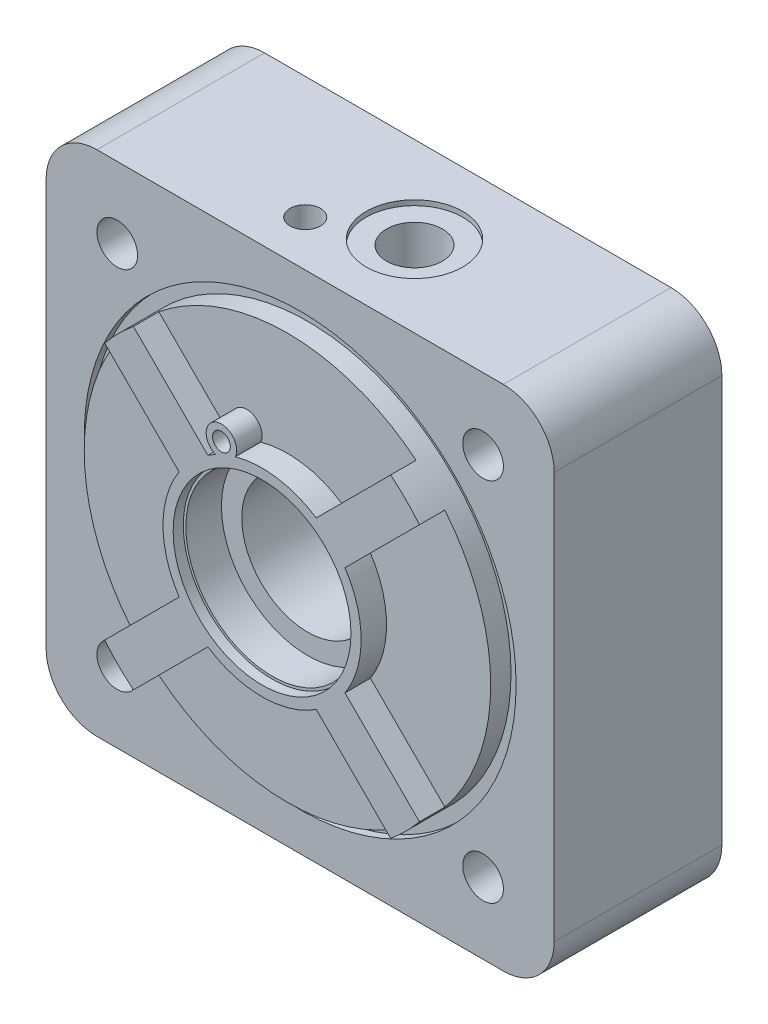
ISO-10303-21;
HEADER;
FILE_DESCRIPTION(('STEP AP214'),'2;1');
FILE_NAME('part.step','',(''),(''),'','','');
FILE_SCHEMA(('AUTOMOTIVE_DESIGN { 1 0 10303 214 1 1 1 1 }'));
ENDSEC;
DATA;
#1=APPLICATION_CONTEXT('core data for automotive mechanical design processes');
#2=APPLICATION_PROTOCOL_DEFINITION('international standard','automotive_design',2000,#1);
#3=PRODUCT_CONTEXT('',#1,'mechanical');
#4=PRODUCT('Part','Part','',(#3));
#5=PRODUCT_RELATED_PRODUCT_CATEGORY('part','',(#4));
#6=PRODUCT_DEFINITION_FORMATION('','',#4);
#7=PRODUCT_DEFINITION_CONTEXT('part definition',#1,'design');
#8=PRODUCT_DEFINITION('design','',#6,#7);
#9=PRODUCT_DEFINITION_SHAPE('','',#8);
#10=(LENGTH_UNIT() NAMED_UNIT(*) SI_UNIT(.MILLI.,.METRE.));
#11=(NAMED_UNIT(*) PLANE_ANGLE_UNIT() SI_UNIT($,.RADIAN.));
#12=(NAMED_UNIT(*) SI_UNIT($,.STERADIAN.) SOLID_ANGLE_UNIT());
#13=UNCERTAINTY_MEASURE_WITH_UNIT(LENGTH_MEASURE(1.E-05),#10,'distance_accuracy_value','');
#14=(GEOMETRIC_REPRESENTATION_CONTEXT(3) GLOBAL_UNCERTAINTY_ASSIGNED_CONTEXT((#13)) GLOBAL_UNIT_ASSIGNED_CONTEXT((#10,
#11,#12)) REPRESENTATION_CONTEXT('',''));
#15=CARTESIAN_POINT('',(0.,0.,0.));
#16=DIRECTION('',(0.,0.,1.));
#17=DIRECTION('',(1.,0.,0.));
#18=AXIS2_PLACEMENT_3D('',#15,#16,#17);
#19=CARTESIAN_POINT('',(-1.66533453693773E-13,0.,3.5));
#20=DIRECTION('',(0.,0.,1.));
#21=DIRECTION('',(1.,0.,0.));
#22=AXIS2_PLACEMENT_3D('',#19,#20,#21);
#23=PLANE('',#22);
#24=DIRECTION('',(-0.707106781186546,0.707106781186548,0.));
#25=VECTOR('',#24,1.);
#26=CARTESIAN_POINT('',(-10.6669424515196,16.323796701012,3.49999999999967));
#27=LINE('',#26,#25);
#28=CARTESIAN_POINT('',(-10.6669424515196,16.323796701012,3.49999999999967));
#29=VERTEX_POINT('',#28);
#30=CARTESIAN_POINT('',(-25.3140674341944,30.9709216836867,3.49999999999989));
#31=VERTEX_POINT('',#30);
#32=EDGE_CURVE('E62',#29,#31,#27,.T.);
#33=ORIENTED_EDGE('',*,*,#32,.F.);
#34=CARTESIAN_POINT('',(-1.66533453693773E-13,0.,3.5));
#35=DIRECTION('',(0.,0.,1.));
#36=DIRECTION('',(1.,0.,0.));
#37=AXIS2_PLACEMENT_3D('',#34,#35,#36);
#38=CIRCLE('',#37,19.5);
#39=CARTESIAN_POINT('',(-9.14025831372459,17.2251466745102,3.49999999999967));
#40=VERTEX_POINT('',#39);
#41=EDGE_CURVE('E552',#40,#29,#38,.T.);
#42=ORIENTED_EDGE('',*,*,#41,.F.);
#43=CARTESIAN_POINT('',(-8.00000000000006,20.0000000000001,3.49999999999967));
#44=DIRECTION('',(0.,0.,1.));
#45=DIRECTION('',(-1.,0.,0.));
#46=AXIS2_PLACEMENT_3D('',#43,#44,#45);
#47=CIRCLE('',#46,2.99999999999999);
#48=CARTESIAN_POINT('',(-5.26060375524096,18.7770084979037,3.49999999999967));
#49=VERTEX_POINT('',#48);
#50=EDGE_CURVE('E810',#49,#40,#47,.T.);
#51=ORIENTED_EDGE('',*,*,#50,.F.);
#52=CARTESIAN_POINT('',(-1.66533453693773E-13,0.,3.5));
#53=DIRECTION('',(0.,0.,1.));
#54=DIRECTION('',(1.,0.,0.));
#55=AXIS2_PLACEMENT_3D('',#52,#53,#54);
#56=CIRCLE('',#55,19.5);
#57=CARTESIAN_POINT('',(10.6669424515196,16.323796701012,3.49999999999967));
#58=VERTEX_POINT('',#57);
#59=EDGE_CURVE('E808',#58,#49,#56,.T.);
#60=ORIENTED_EDGE('',*,*,#59,.F.);
#61=DIRECTION('',(-0.707106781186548,-0.707106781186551,0.));
#62=VECTOR('',#61,1.);
#63=CARTESIAN_POINT('',(10.6669424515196,16.323796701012,3.49999999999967));
#64=LINE('',#63,#62);
#65=CARTESIAN_POINT('',(25.3140674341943,30.9709216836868,3.49999999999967));
#66=VERTEX_POINT('',#65);
#67=EDGE_CURVE('E780',#66,#58,#64,.T.);
#68=ORIENTED_EDGE('',*,*,#67,.F.);
#69=CARTESIAN_POINT('',(-1.66533453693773E-13,0.,3.5));
#70=DIRECTION('',(0.,0.,1.));
#71=DIRECTION('',(1.,0.,0.));
#72=AXIS2_PLACEMENT_3D('',#69,#70,#71);
#73=CIRCLE('',#72,40.);
#74=EDGE_CURVE('E633',#66,#31,#73,.T.);
#75=ORIENTED_EDGE('',*,*,#74,.T.);
#76=EDGE_LOOP('',(#33,#42,#51,#60,#68,#75));
#77=FACE_BOUND('',#76,.T.);
#78=ADVANCED_FACE('F38',(#77),#23,.T.);
#79=DIRECTION('',(0.707106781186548,0.707106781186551,0.));
#80=VECTOR('',#79,1.);
#81=CARTESIAN_POINT('',(16.3237967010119,10.6669424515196,3.5));
#82=LINE('',#81,#80);
#83=CARTESIAN_POINT('',(16.3237967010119,10.6669424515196,3.5));
#84=VERTEX_POINT('',#83);
#85=CARTESIAN_POINT('',(30.9709216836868,25.3140674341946,3.49999999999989));
#86=VERTEX_POINT('',#85);
#87=EDGE_CURVE('E766',#84,#86,#82,.T.);
#88=ORIENTED_EDGE('',*,*,#87,.F.);
#89=CARTESIAN_POINT('',(-1.66533453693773E-13,0.,3.5));
#90=DIRECTION('',(0.,0.,1.));
#91=DIRECTION('',(1.,0.,0.));
#92=AXIS2_PLACEMENT_3D('',#89,#90,#91);
#93=CIRCLE('',#92,19.5);
#94=CARTESIAN_POINT('',(16.3237967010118,-10.6669424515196,3.49999999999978));
#95=VERTEX_POINT('',#94);
#96=EDGE_CURVE('E781',#95,#84,#93,.T.);
#97=ORIENTED_EDGE('',*,*,#96,.F.);
#98=DIRECTION('',(-0.707106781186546,0.707106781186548,0.));
#99=VECTOR('',#98,1.);
#100=CARTESIAN_POINT('',(16.3237967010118,-10.6669424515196,3.49999999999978));
#101=LINE('',#100,#99);
#102=CARTESIAN_POINT('',(30.9709216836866,-25.3140674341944,3.49999999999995));
#103=VERTEX_POINT('',#102);
#104=EDGE_CURVE('E769',#103,#95,#101,.T.);
#105=ORIENTED_EDGE('',*,*,#104,.F.);
#106=EDGE_CURVE('E527',#103,#86,#73,.T.);
#107=ORIENTED_EDGE('',*,*,#106,.T.);
#108=EDGE_LOOP('',(#88,#97,#105,#107));
#109=FACE_BOUND('',#108,.T.);
#110=ADVANCED_FACE('F765',(#109),#23,.T.);
#111=DIRECTION('',(0.707106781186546,-0.707106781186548,0.));
#112=VECTOR('',#111,1.);
#113=CARTESIAN_POINT('',(10.6669424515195,-16.323796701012,3.5));
#114=LINE('',#113,#112);
#115=CARTESIAN_POINT('',(10.6669424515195,-16.323796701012,3.5));
#116=VERTEX_POINT('',#115);
#117=CARTESIAN_POINT('',(25.3140674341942,-30.9709216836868,3.5));
#118=VERTEX_POINT('',#117);
#119=EDGE_CURVE('E796',#116,#118,#114,.T.);
#120=ORIENTED_EDGE('',*,*,#119,.F.);
#121=CARTESIAN_POINT('',(-1.66533453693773E-13,0.,3.5));
#122=DIRECTION('',(0.,0.,1.));
#123=DIRECTION('',(1.,0.,0.));
#124=AXIS2_PLACEMENT_3D('',#121,#122,#123);
#125=CIRCLE('',#124,19.5);
#126=CARTESIAN_POINT('',(-10.6669424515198,-16.3237967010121,3.5));
#127=VERTEX_POINT('',#126);
#128=EDGE_CURVE('E520',#127,#116,#125,.T.);
#129=ORIENTED_EDGE('',*,*,#128,.F.);
#130=DIRECTION('',(0.707106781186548,0.707106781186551,0.));
#131=VECTOR('',#130,1.);
#132=CARTESIAN_POINT('',(-10.6669424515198,-16.3237967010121,3.5));
#133=LINE('',#132,#131);
#134=CARTESIAN_POINT('',(-25.3140674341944,-30.970921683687,3.5));
#135=VERTEX_POINT('',#134);
#136=EDGE_CURVE('E526',#135,#127,#133,.T.);
#137=ORIENTED_EDGE('',*,*,#136,.F.);
#138=EDGE_CURVE('E758',#135,#118,#73,.T.);
#139=ORIENTED_EDGE('',*,*,#138,.T.);
#140=EDGE_LOOP('',(#120,#129,#137,#139));
#141=FACE_BOUND('',#140,.T.);
#142=ADVANCED_FACE('F849',(#141),#23,.T.);
#143=CARTESIAN_POINT('',(0.,0.,-0.5));
#144=DIRECTION('',(0.,0.,1.));
#145=DIRECTION('',(1.,0.,0.));
#146=AXIS2_PLACEMENT_3D('',#143,#144,#145);
#147=PLANE('',#146);
#148=CARTESIAN_POINT('',(0.,0.,-0.5));
#149=DIRECTION('',(0.,0.,1.));
#150=DIRECTION('',(1.,0.,0.));
#151=AXIS2_PLACEMENT_3D('',#148,#149,#150);
#152=CIRCLE('',#151,42.5);
#153=CARTESIAN_POINT('',(42.5,0.,-0.500000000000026));
#154=VERTEX_POINT('',#153);
#155=EDGE_CURVE('E632',#154,#154,#152,.T.);
#156=ORIENTED_EDGE('',*,*,#155,.T.);
#157=EDGE_LOOP('',(#156));
#158=FACE_BOUND('',#157,.T.);
#159=CARTESIAN_POINT('',(0.,0.,-0.5));
#160=DIRECTION('',(0.,0.,1.));
#161=DIRECTION('',(1.,0.,0.));
#162=AXIS2_PLACEMENT_3D('',#159,#160,#161);
#163=CIRCLE('',#162,40.);
#164=CARTESIAN_POINT('',(40.,0.,-0.500000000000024));
#165=VERTEX_POINT('',#164);
#166=EDGE_CURVE('E626',#165,#165,#163,.T.);
#167=ORIENTED_EDGE('',*,*,#166,.F.);
#168=EDGE_LOOP('',(#167));
#169=FACE_BOUND('',#168,.T.);
#170=ADVANCED_FACE('F864',(#158,#169),#147,.T.);
#171=CARTESIAN_POINT('',(40.,40.0000000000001,-32.0000000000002));
#172=DIRECTION('',(0.,0.,-1.));
#173=DIRECTION('',(-1.,0.,0.));
#174=AXIS2_PLACEMENT_3D('',#171,#172,#173);
#175=PLANE('',#174);
#176=CARTESIAN_POINT('',(-32.,32.0000000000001,-32.0000000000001));
#177=DIRECTION('',(0.,0.,-1.));
#178=DIRECTION('',(-1.,0.,0.));
#179=AXIS2_PLACEMENT_3D('',#176,#177,#178);
#180=CIRCLE('',#179,7.);
#181=CARTESIAN_POINT('',(-32.,25.,-32.));
#182=VERTEX_POINT('',#181);
#183=CARTESIAN_POINT('',(-25.,32.0000000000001,-32.0000000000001));
#184=VERTEX_POINT('',#183);
#185=EDGE_CURVE('E13',#182,#184,#180,.F.);
#186=ORIENTED_EDGE('',*,*,#185,.F.);
#187=DIRECTION('',(1.,0.,0.));
#188=VECTOR('',#187,1.);
#189=CARTESIAN_POINT('',(40.,25.0000000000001,-32.));
#190=LINE('',#189,#188);
#191=CARTESIAN_POINT('',(-38.,25.,-32.));
#192=VERTEX_POINT('',#191);
#193=EDGE_CURVE('E47',#192,#182,#190,.T.);
#194=ORIENTED_EDGE('',*,*,#193,.F.);
#195=CARTESIAN_POINT('',(-38.,23.,-32.));
#196=DIRECTION('',(0.,0.,-1.));
#197=DIRECTION('',(-1.,0.,0.));
#198=AXIS2_PLACEMENT_3D('',#195,#196,#197);
#199=CIRCLE('',#198,2.);
#200=CARTESIAN_POINT('',(-40.,23.,-32.0000000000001));
#201=VERTEX_POINT('',#200);
#202=EDGE_CURVE('E939',#201,#192,#199,.T.);
#203=ORIENTED_EDGE('',*,*,#202,.F.);
#204=DIRECTION('',(0.,1.,0.));
#205=VECTOR('',#204,1.);
#206=CARTESIAN_POINT('',(-40.,40.0000000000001,-32.0000000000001));
#207=LINE('',#206,#205);
#208=CARTESIAN_POINT('',(-40.0000000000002,-23.0000000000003,-32.0000000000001));
#209=VERTEX_POINT('',#208);
#210=EDGE_CURVE('E937',#209,#201,#207,.T.);
#211=ORIENTED_EDGE('',*,*,#210,.F.);
#212=CARTESIAN_POINT('',(-38.0000000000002,-23.0000000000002,-32.0000000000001));
#213=DIRECTION('',(0.,0.,-1.));
#214=DIRECTION('',(-1.,0.,0.));
#215=AXIS2_PLACEMENT_3D('',#212,#213,#214);
#216=CIRCLE('',#215,2.);
#217=CARTESIAN_POINT('',(-38.0000000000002,-25.0000000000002,-32.0000000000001));
#218=VERTEX_POINT('',#217);
#219=EDGE_CURVE('E935',#218,#209,#216,.T.);
#220=ORIENTED_EDGE('',*,*,#219,.F.);
#221=DIRECTION('',(-1.,0.,0.));
#222=VECTOR('',#221,1.);
#223=CARTESIAN_POINT('',(39.9999999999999,-24.9999999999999,-32.0000000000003));
#224=LINE('',#223,#222);
#225=CARTESIAN_POINT('',(-32.0000000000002,-25.0000000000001,-32.));
#226=VERTEX_POINT('',#225);
#227=EDGE_CURVE('E933',#226,#218,#224,.T.);
#228=ORIENTED_EDGE('',*,*,#227,.F.);
#229=CARTESIAN_POINT('',(-32.0000000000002,-32.0000000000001,-32.0000000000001));
#230=DIRECTION('',(0.,0.,-1.));
#231=DIRECTION('',(-1.,0.,0.));
#232=AXIS2_PLACEMENT_3D('',#229,#230,#231);
#233=CIRCLE('',#232,7.);
#234=CARTESIAN_POINT('',(-25.0000000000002,-32.0000000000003,-32.));
#235=VERTEX_POINT('',#234);
#236=EDGE_CURVE('E931',#235,#226,#233,.F.);
#237=ORIENTED_EDGE('',*,*,#236,.F.);
#238=DIRECTION('',(0.,1.,0.));
#239=VECTOR('',#238,1.);
#240=CARTESIAN_POINT('',(-25.,40.0000000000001,-32.0000000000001));
#241=LINE('',#240,#239);
#242=CARTESIAN_POINT('',(-25.0000000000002,-38.0000000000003,-32.));
#243=VERTEX_POINT('',#242);
#244=EDGE_CURVE('E929',#243,#235,#241,.T.);
#245=ORIENTED_EDGE('',*,*,#244,.F.);
#246=CARTESIAN_POINT('',(-23.0000000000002,-38.0000000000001,-32.));
#247=DIRECTION('',(0.,0.,-1.));
#248=DIRECTION('',(-1.,0.,0.));
#249=AXIS2_PLACEMENT_3D('',#246,#247,#248);
#250=CIRCLE('',#249,2.00000000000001);
#251=CARTESIAN_POINT('',(-23.0000000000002,-40.0000000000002,-32.0000000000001));
#252=VERTEX_POINT('',#251);
#253=EDGE_CURVE('E927',#252,#243,#250,.T.);
#254=ORIENTED_EDGE('',*,*,#253,.F.);
#255=DIRECTION('',(-1.,0.,0.));
#256=VECTOR('',#255,1.);
#257=CARTESIAN_POINT('',(39.9999999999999,-40.,-32.0000000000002));
#258=LINE('',#257,#256);
#259=CARTESIAN_POINT('',(22.9999999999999,-40.0000000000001,-32.0000000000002));
#260=VERTEX_POINT('',#259);
#261=EDGE_CURVE('E925',#260,#252,#258,.T.);
#262=ORIENTED_EDGE('',*,*,#261,.F.);
#263=CARTESIAN_POINT('',(22.9999999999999,-38.0000000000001,-32.0000000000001));
#264=DIRECTION('',(0.,0.,-1.));
#265=DIRECTION('',(-1.,0.,0.));
#266=AXIS2_PLACEMENT_3D('',#263,#264,#265);
#267=CIRCLE('',#266,2.00000000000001);
#268=CARTESIAN_POINT('',(24.9999999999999,-38.0000000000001,-32.));
#269=VERTEX_POINT('',#268);
#270=EDGE_CURVE('E923',#269,#260,#267,.T.);
#271=ORIENTED_EDGE('',*,*,#270,.F.);
#272=DIRECTION('',(0.,-1.,0.));
#273=VECTOR('',#272,1.);
#274=CARTESIAN_POINT('',(25.,40.0000000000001,-32.0000000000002));
#275=LINE('',#274,#273);
#276=CARTESIAN_POINT('',(24.9999999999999,-32.,-32.));
#277=VERTEX_POINT('',#276);
#278=EDGE_CURVE('E921',#277,#269,#275,.T.);
#279=ORIENTED_EDGE('',*,*,#278,.F.);
#280=CARTESIAN_POINT('',(31.9999999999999,-32.0000000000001,-32.0000000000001));
#281=DIRECTION('',(0.,0.,-1.));
#282=DIRECTION('',(-1.,0.,0.));
#283=AXIS2_PLACEMENT_3D('',#280,#281,#282);
#284=CIRCLE('',#283,7.);
#285=CARTESIAN_POINT('',(31.9999999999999,-25.0000000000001,-32.0000000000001));
#286=VERTEX_POINT('',#285);
#287=EDGE_CURVE('E919',#286,#277,#284,.F.);
#288=ORIENTED_EDGE('',*,*,#287,.F.);
#289=DIRECTION('',(-1.,0.,0.));
#290=VECTOR('',#289,1.);
#291=CARTESIAN_POINT('',(39.9999999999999,-24.9999999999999,-32.0000000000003));
#292=LINE('',#291,#290);
#293=CARTESIAN_POINT('',(37.9999999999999,-25.,-32.0000000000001));
#294=VERTEX_POINT('',#293);
#295=EDGE_CURVE('E917',#294,#286,#292,.T.);
#296=ORIENTED_EDGE('',*,*,#295,.F.);
#297=CARTESIAN_POINT('',(37.9999999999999,-23.,-32.0000000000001));
#298=DIRECTION('',(0.,0.,-1.));
#299=DIRECTION('',(-1.,0.,0.));
#300=AXIS2_PLACEMENT_3D('',#297,#298,#299);
#301=CIRCLE('',#300,2.);
#302=CARTESIAN_POINT('',(39.9999999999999,-22.9999999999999,-32.));
#303=VERTEX_POINT('',#302);
#304=EDGE_CURVE('E915',#303,#294,#301,.T.);
#305=ORIENTED_EDGE('',*,*,#304,.F.);
#306=DIRECTION('',(0.,-1.,0.));
#307=VECTOR('',#306,1.);
#308=CARTESIAN_POINT('',(40.,40.0000000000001,-32.0000000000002));
#309=LINE('',#308,#307);
#310=CARTESIAN_POINT('',(40.,23.0000000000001,-32.));
#311=VERTEX_POINT('',#310);
#312=EDGE_CURVE('E913',#311,#303,#309,.T.);
#313=ORIENTED_EDGE('',*,*,#312,.F.);
#314=CARTESIAN_POINT('',(38.,23.0000000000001,-32.));
#315=DIRECTION('',(0.,0.,-1.));
#316=DIRECTION('',(-1.,0.,0.));
#317=AXIS2_PLACEMENT_3D('',#314,#315,#316);
#318=CIRCLE('',#317,2.);
#319=CARTESIAN_POINT('',(38.,25.0000000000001,-32.));
#320=VERTEX_POINT('',#319);
#321=EDGE_CURVE('E911',#320,#311,#318,.T.);
#322=ORIENTED_EDGE('',*,*,#321,.F.);
#323=DIRECTION('',(1.,0.,0.));
#324=VECTOR('',#323,1.);
#325=CARTESIAN_POINT('',(40.,25.0000000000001,-32.));
#326=LINE('',#325,#324);
#327=CARTESIAN_POINT('',(32.,25.0000000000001,-32.0000000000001));
#328=VERTEX_POINT('',#327);
#329=EDGE_CURVE('E909',#328,#320,#326,.T.);
#330=ORIENTED_EDGE('',*,*,#329,.F.);
#331=CARTESIAN_POINT('',(32.,32.0000000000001,-32.0000000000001));
#332=DIRECTION('',(0.,0.,-1.));
#333=DIRECTION('',(-1.,0.,0.));
#334=AXIS2_PLACEMENT_3D('',#331,#332,#333);
#335=CIRCLE('',#334,7.);
#336=CARTESIAN_POINT('',(25.,32.0000000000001,-32.0000000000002));
#337=VERTEX_POINT('',#336);
#338=EDGE_CURVE('E907',#337,#328,#335,.F.);
#339=ORIENTED_EDGE('',*,*,#338,.F.);
#340=DIRECTION('',(0.,-1.,0.));
#341=VECTOR('',#340,1.);
#342=CARTESIAN_POINT('',(25.,40.0000000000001,-32.0000000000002));
#343=LINE('',#342,#341);
#344=CARTESIAN_POINT('',(25.,38.0000000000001,-32.0000000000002));
#345=VERTEX_POINT('',#344);
#346=EDGE_CURVE('E905',#345,#337,#343,.T.);
#347=ORIENTED_EDGE('',*,*,#346,.F.);
#348=CARTESIAN_POINT('',(23.,38.0000000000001,-32.0000000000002));
#349=DIRECTION('',(0.,0.,-1.));
#350=DIRECTION('',(-1.,0.,0.));
#351=AXIS2_PLACEMENT_3D('',#348,#349,#350);
#352=CIRCLE('',#351,2.00000000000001);
#353=CARTESIAN_POINT('',(23.,40.0000000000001,-32.0000000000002));
#354=VERTEX_POINT('',#353);
#355=EDGE_CURVE('E903',#354,#345,#352,.T.);
#356=ORIENTED_EDGE('',*,*,#355,.F.);
#357=DIRECTION('',(1.,0.,0.));
#358=VECTOR('',#357,1.);
#359=CARTESIAN_POINT('',(40.,40.0000000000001,-32.0000000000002));
#360=LINE('',#359,#358);
#361=CARTESIAN_POINT('',(-23.,40.0000000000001,-32.0000000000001));
#362=VERTEX_POINT('',#361);
#363=EDGE_CURVE('E901',#362,#354,#360,.T.);
#364=ORIENTED_EDGE('',*,*,#363,.F.);
#365=CARTESIAN_POINT('',(-23.,38.,-32.0000000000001));
#366=DIRECTION('',(0.,0.,-1.));
#367=DIRECTION('',(-1.,0.,0.));
#368=AXIS2_PLACEMENT_3D('',#365,#366,#367);
#369=CIRCLE('',#368,2.00000000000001);
#370=CARTESIAN_POINT('',(-25.,38.0000000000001,-32.0000000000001));
#371=VERTEX_POINT('',#370);
#372=EDGE_CURVE('E899',#371,#362,#369,.T.);
#373=ORIENTED_EDGE('',*,*,#372,.F.);
#374=DIRECTION('',(0.,1.,0.));
#375=VECTOR('',#374,1.);
#376=CARTESIAN_POINT('',(-25.,40.0000000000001,-32.0000000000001));
#377=LINE('',#376,#375);
#378=EDGE_CURVE('E722',#184,#371,#377,.T.);
#379=ORIENTED_EDGE('',*,*,#378,.F.);
#380=EDGE_LOOP('',(#186,#194,#203,#211,#220,#228,#237,#245,#254,#262,#271,#279,#288,#296,#305,
#313,#322,#330,#339,#347,#356,#364,#373,#379));
#381=FACE_BOUND('',#380,.T.);
#382=CARTESIAN_POINT('',(-36.0000000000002,-36.0000000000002,-32.0000000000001));
#383=DIRECTION('',(0.,0.,-1.));
#384=DIRECTION('',(-1.,0.,0.));
#385=AXIS2_PLACEMENT_3D('',#382,#383,#384);
#386=CIRCLE('',#385,6.5);
#387=CARTESIAN_POINT('',(-42.5000000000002,-36.0000000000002,-32.0000000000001));
#388=VERTEX_POINT('',#387);
#389=EDGE_CURVE('E655',#388,#388,#386,.T.);
#390=ORIENTED_EDGE('',*,*,#389,.F.);
#391=EDGE_LOOP('',(#390));
#392=FACE_BOUND('',#391,.T.);
#393=CARTESIAN_POINT('',(35.9999999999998,-36.0000000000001,-32.0000000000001));
#394=DIRECTION('',(0.,0.,-1.));
#395=DIRECTION('',(-1.,0.,0.));
#396=AXIS2_PLACEMENT_3D('',#393,#394,#395);
#397=CIRCLE('',#396,6.5);
#398=CARTESIAN_POINT('',(29.4999999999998,-36.0000000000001,-32.0000000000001));
#399=VERTEX_POINT('',#398);
#400=EDGE_CURVE('E659',#399,#399,#397,.T.);
#401=ORIENTED_EDGE('',*,*,#400,.F.);
#402=EDGE_LOOP('',(#401));
#403=FACE_BOUND('',#402,.T.);
#404=CARTESIAN_POINT('',(36.,36.0000000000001,-32.));
#405=DIRECTION('',(0.,0.,-1.));
#406=DIRECTION('',(-1.,0.,0.));
#407=AXIS2_PLACEMENT_3D('',#404,#405,#406);
#408=CIRCLE('',#407,6.5);
#409=CARTESIAN_POINT('',(29.5,36.0000000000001,-32.));
#410=VERTEX_POINT('',#409);
#411=EDGE_CURVE('E663',#410,#410,#408,.T.);
#412=ORIENTED_EDGE('',*,*,#411,.F.);
#413=EDGE_LOOP('',(#412));
#414=FACE_BOUND('',#413,.T.);
#415=CARTESIAN_POINT('',(-36.,36.,-32.));
#416=DIRECTION('',(0.,0.,-1.));
#417=DIRECTION('',(-1.,0.,0.));
#418=AXIS2_PLACEMENT_3D('',#415,#416,#417);
#419=CIRCLE('',#418,6.5);
#420=CARTESIAN_POINT('',(-42.5,36.,-32.));
#421=VERTEX_POINT('',#420);
#422=EDGE_CURVE('E667',#421,#421,#419,.T.);
#423=ORIENTED_EDGE('',*,*,#422,.F.);
#424=EDGE_LOOP('',(#423));
#425=FACE_BOUND('',#424,.T.);
#426=CARTESIAN_POINT('',(40.,40.0000000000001,-32.0000000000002));
#427=DIRECTION('',(0.,0.,1.));
#428=DIRECTION('',(-1.,0.,0.));
#429=AXIS2_PLACEMENT_3D('',#426,#427,#428);
#430=CIRCLE('',#429,10.);
#431=CARTESIAN_POINT('',(50.,40.0000000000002,-32.0000000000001));
#432=VERTEX_POINT('',#431);
#433=CARTESIAN_POINT('',(40.,50.0000000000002,-32.0000000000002));
#434=VERTEX_POINT('',#433);
#435=EDGE_CURVE('E695',#432,#434,#430,.T.);
#436=ORIENTED_EDGE('',*,*,#435,.F.);
#437=DIRECTION('',(0.,1.,0.));
#438=VECTOR('',#437,1.);
#439=CARTESIAN_POINT('',(50.,40.0000000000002,-32.0000000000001));
#440=LINE('',#439,#438);
#441=CARTESIAN_POINT('',(49.9999999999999,-40.,-32.0000000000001));
#442=VERTEX_POINT('',#441);
#443=EDGE_CURVE('E716',#442,#432,#440,.T.);
#444=ORIENTED_EDGE('',*,*,#443,.F.);
#445=CARTESIAN_POINT('',(39.9999999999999,-40.,-32.0000000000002));
#446=DIRECTION('',(0.,0.,1.));
#447=DIRECTION('',(1.,0.,0.));
#448=AXIS2_PLACEMENT_3D('',#445,#446,#447);
#449=CIRCLE('',#448,10.);
#450=CARTESIAN_POINT('',(39.9999999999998,-50.,-32.0000000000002));
#451=VERTEX_POINT('',#450);
#452=EDGE_CURVE('E713',#451,#442,#449,.T.);
#453=ORIENTED_EDGE('',*,*,#452,.F.);
#454=DIRECTION('',(1.,0.,0.));
#455=VECTOR('',#454,1.);
#456=CARTESIAN_POINT('',(39.9999999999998,-50.,-32.0000000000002));
#457=LINE('',#456,#455);
#458=CARTESIAN_POINT('',(-40.,-50.0000000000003,-32.0000000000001));
#459=VERTEX_POINT('',#458);
#460=EDGE_CURVE('E710',#459,#451,#457,.T.);
#461=ORIENTED_EDGE('',*,*,#460,.F.);
#462=CARTESIAN_POINT('',(-40.0000000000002,-40.0000000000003,-32.0000000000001));
#463=DIRECTION('',(0.,0.,1.));
#464=DIRECTION('',(1.,0.,0.));
#465=AXIS2_PLACEMENT_3D('',#462,#463,#464);
#466=CIRCLE('',#465,10.);
#467=CARTESIAN_POINT('',(-50.0000000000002,-40.0000000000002,-32.0000000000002));
#468=VERTEX_POINT('',#467);
#469=EDGE_CURVE('E707',#468,#459,#466,.T.);
#470=ORIENTED_EDGE('',*,*,#469,.F.);
#471=DIRECTION('',(0.,-1.,0.));
#472=VECTOR('',#471,1.);
#473=CARTESIAN_POINT('',(-50.,40.0000000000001,-32.0000000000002));
#474=LINE('',#473,#472);
#475=CARTESIAN_POINT('',(-50.,40.0000000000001,-32.0000000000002));
#476=VERTEX_POINT('',#475);
#477=EDGE_CURVE('E704',#476,#468,#474,.T.);
#478=ORIENTED_EDGE('',*,*,#477,.F.);
#479=CARTESIAN_POINT('',(-40.,40.0000000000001,-32.0000000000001));
#480=DIRECTION('',(0.,0.,1.));
#481=DIRECTION('',(1.,0.,0.));
#482=AXIS2_PLACEMENT_3D('',#479,#480,#481);
#483=CIRCLE('',#482,10.);
#484=CARTESIAN_POINT('',(-40.,50.,-32.0000000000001));
#485=VERTEX_POINT('',#484);
#486=EDGE_CURVE('E701',#485,#476,#483,.T.);
#487=ORIENTED_EDGE('',*,*,#486,.F.);
#488=DIRECTION('',(-1.,0.,0.));
#489=VECTOR('',#488,1.);
#490=CARTESIAN_POINT('',(-40.,50.,-32.0000000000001));
#491=LINE('',#490,#489);
#492=EDGE_CURVE('E698',#434,#485,#491,.T.);
#493=ORIENTED_EDGE('',*,*,#492,.F.);
#494=EDGE_LOOP('',(#436,#444,#453,#461,#470,#478,#487,#493));
#495=FACE_BOUND('',#494,.T.);
#496=ADVANCED_FACE('F868',(#381,#392,#403,#414,#425,#495),#175,.T.);
#497=CARTESIAN_POINT('',(40.,40.0000000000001,-32.0000000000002));
#498=DIRECTION('',(0.,0.,1.));
#499=DIRECTION('',(1.,0.,0.));
#500=AXIS2_PLACEMENT_3D('',#497,#498,#499);
#501=CYLINDRICAL_SURFACE('',#500,10.);
#502=DIRECTION('',(0.,0.,1.));
#503=VECTOR('',#502,1.);
#504=CARTESIAN_POINT('',(40.,50.0000000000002,-32.0000000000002));
#505=LINE('',#504,#503);
#506=CARTESIAN_POINT('',(40.,50.0000000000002,0.999999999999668));
#507=VERTEX_POINT('',#506);
#508=EDGE_CURVE('E719',#434,#507,#505,.T.);
#509=ORIENTED_EDGE('',*,*,#508,.T.);
#510=CARTESIAN_POINT('',(40.,40.0000000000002,0.999999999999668));
#511=DIRECTION('',(0.,0.,1.));
#512=DIRECTION('',(-1.,0.,0.));
#513=AXIS2_PLACEMENT_3D('',#510,#511,#512);
#514=CIRCLE('',#513,10.);
#515=CARTESIAN_POINT('',(50.,40.0000000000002,0.99999999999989));
#516=VERTEX_POINT('',#515);
#517=EDGE_CURVE('E671',#516,#507,#514,.T.);
#518=ORIENTED_EDGE('',*,*,#517,.F.);
#519=DIRECTION('',(0.,0.,1.));
#520=VECTOR('',#519,1.);
#521=CARTESIAN_POINT('',(50.,40.0000000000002,-32.0000000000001));
#522=LINE('',#521,#520);
#523=EDGE_CURVE('E720',#432,#516,#522,.T.);
#524=ORIENTED_EDGE('',*,*,#523,.F.);
#525=ORIENTED_EDGE('',*,*,#435,.T.);
#526=EDGE_LOOP('',(#509,#518,#524,#525));
#527=FACE_BOUND('',#526,.T.);
#528=ADVANCED_FACE('F40',(#527),#501,.T.);
#529=CARTESIAN_POINT('',(50.,40.0000000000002,-32.0000000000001));
#530=DIRECTION('',(1.,0.,0.));
#531=DIRECTION('',(0.,0.,-1.));
#532=AXIS2_PLACEMENT_3D('',#529,#530,#531);
#533=PLANE('',#532);
#534=ORIENTED_EDGE('',*,*,#523,.T.);
#535=DIRECTION('',(0.,1.,0.));
#536=VECTOR('',#535,1.);
#537=CARTESIAN_POINT('',(50.,40.0000000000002,0.99999999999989));
#538=LINE('',#537,#536);
#539=CARTESIAN_POINT('',(49.9999999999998,-40.0000000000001,0.99999999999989));
#540=VERTEX_POINT('',#539);
#541=EDGE_CURVE('E692',#540,#516,#538,.T.);
#542=ORIENTED_EDGE('',*,*,#541,.F.);
#543=DIRECTION('',(0.,0.,1.));
#544=VECTOR('',#543,1.);
#545=CARTESIAN_POINT('',(49.9999999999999,-40.,-32.0000000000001));
#546=LINE('',#545,#544);
#547=EDGE_CURVE('E723',#442,#540,#546,.T.);
#548=ORIENTED_EDGE('',*,*,#547,.F.);
#549=ORIENTED_EDGE('',*,*,#443,.T.);
#550=EDGE_LOOP('',(#534,#542,#548,#549));
#551=FACE_BOUND('',#550,.T.);
#552=ADVANCED_FACE('F1072',(#551),#533,.T.);
#553=CARTESIAN_POINT('',(39.9999999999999,-40.,-32.0000000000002));
#554=DIRECTION('',(0.,0.,1.));
#555=DIRECTION('',(1.,0.,0.));
#556=AXIS2_PLACEMENT_3D('',#553,#554,#555);
#557=CYLINDRICAL_SURFACE('',#556,10.);
#558=ORIENTED_EDGE('',*,*,#547,.T.);
#559=CARTESIAN_POINT('',(39.9999999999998,-40.,0.999999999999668));
#560=DIRECTION('',(0.,0.,1.));
#561=DIRECTION('',(1.,0.,0.));
#562=AXIS2_PLACEMENT_3D('',#559,#560,#561);
#563=CIRCLE('',#562,10.);
#564=CARTESIAN_POINT('',(39.9999999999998,-50.,0.999999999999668));
#565=VERTEX_POINT('',#564);
#566=EDGE_CURVE('E689',#565,#540,#563,.T.);
#567=ORIENTED_EDGE('',*,*,#566,.F.);
#568=DIRECTION('',(0.,0.,1.));
#569=VECTOR('',#568,1.);
#570=CARTESIAN_POINT('',(39.9999999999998,-50.,-32.0000000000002));
#571=LINE('',#570,#569);
#572=EDGE_CURVE('E725',#451,#565,#571,.T.);
#573=ORIENTED_EDGE('',*,*,#572,.F.);
#574=ORIENTED_EDGE('',*,*,#452,.T.);
#575=EDGE_LOOP('',(#558,#567,#573,#574));
#576=FACE_BOUND('',#575,.T.);
#577=ADVANCED_FACE('F1069',(#576),#557,.T.);
#578=CARTESIAN_POINT('',(39.9999999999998,-50.,-32.0000000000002));
#579=DIRECTION('',(0.,-1.,0.));
#580=DIRECTION('',(0.,0.,-1.));
#581=AXIS2_PLACEMENT_3D('',#578,#579,#580);
#582=PLANE('',#581);
#583=ORIENTED_EDGE('',*,*,#572,.T.);
#584=DIRECTION('',(1.,0.,0.));
#585=VECTOR('',#584,1.);
#586=CARTESIAN_POINT('',(39.9999999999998,-50.,0.999999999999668));
#587=LINE('',#586,#585);
#588=CARTESIAN_POINT('',(-40.0000000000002,-50.0000000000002,0.99999999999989));
#589=VERTEX_POINT('',#588);
#590=EDGE_CURVE('E686',#589,#565,#587,.T.);
#591=ORIENTED_EDGE('',*,*,#590,.F.);
#592=DIRECTION('',(0.,0.,1.));
#593=VECTOR('',#592,1.);
#594=CARTESIAN_POINT('',(-40.,-50.0000000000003,-32.0000000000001));
#595=LINE('',#594,#593);
#596=EDGE_CURVE('E727',#459,#589,#595,.T.);
#597=ORIENTED_EDGE('',*,*,#596,.F.);
#598=ORIENTED_EDGE('',*,*,#460,.T.);
#599=EDGE_LOOP('',(#583,#591,#597,#598));
#600=FACE_BOUND('',#599,.T.);
#601=ADVANCED_FACE('F1067',(#600),#582,.T.);
#602=CARTESIAN_POINT('',(-40.0000000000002,-40.0000000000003,-32.0000000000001));
#603=DIRECTION('',(0.,0.,1.));
#604=DIRECTION('',(1.,0.,0.));
#605=AXIS2_PLACEMENT_3D('',#602,#603,#604);
#606=CYLINDRICAL_SURFACE('',#605,10.);
#607=ORIENTED_EDGE('',*,*,#596,.T.);
#608=CARTESIAN_POINT('',(-40.,-40.0000000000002,0.99999999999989));
#609=DIRECTION('',(0.,0.,1.));
#610=DIRECTION('',(1.,0.,0.));
#611=AXIS2_PLACEMENT_3D('',#608,#609,#610);
#612=CIRCLE('',#611,10.);
#613=CARTESIAN_POINT('',(-50.,-40.0000000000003,0.999999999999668));
#614=VERTEX_POINT('',#613);
#615=EDGE_CURVE('E683',#614,#589,#612,.T.);
#616=ORIENTED_EDGE('',*,*,#615,.F.);
#617=DIRECTION('',(0.,0.,1.));
#618=VECTOR('',#617,1.);
#619=CARTESIAN_POINT('',(-50.0000000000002,-40.0000000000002,-32.0000000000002));
#620=LINE('',#619,#618);
#621=EDGE_CURVE('E729',#468,#614,#620,.T.);
#622=ORIENTED_EDGE('',*,*,#621,.F.);
#623=ORIENTED_EDGE('',*,*,#469,.T.);
#624=EDGE_LOOP('',(#607,#616,#622,#623));
#625=FACE_BOUND('',#624,.T.);
#626=ADVANCED_FACE('F1062',(#625),#606,.T.);
#627=CARTESIAN_POINT('',(-50.,40.0000000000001,-32.0000000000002));
#628=DIRECTION('',(-1.,0.,0.));
#629=DIRECTION('',(0.,0.,1.));
#630=AXIS2_PLACEMENT_3D('',#627,#628,#629);
#631=PLANE('',#630);
#632=ORIENTED_EDGE('',*,*,#621,.T.);
#633=DIRECTION('',(0.,-1.,0.));
#634=VECTOR('',#633,1.);
#635=CARTESIAN_POINT('',(-50.,40.0000000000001,0.999999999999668));
#636=LINE('',#635,#634);
#637=CARTESIAN_POINT('',(-50.,40.0000000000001,0.999999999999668));
#638=VERTEX_POINT('',#637);
#639=EDGE_CURVE('E680',#638,#614,#636,.T.);
#640=ORIENTED_EDGE('',*,*,#639,.F.);
#641=DIRECTION('',(0.,0.,1.));
#642=VECTOR('',#641,1.);
#643=CARTESIAN_POINT('',(-50.,40.0000000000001,-32.0000000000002));
#644=LINE('',#643,#642);
#645=EDGE_CURVE('E731',#476,#638,#644,.T.);
#646=ORIENTED_EDGE('',*,*,#645,.F.);
#647=ORIENTED_EDGE('',*,*,#477,.T.);
#648=EDGE_LOOP('',(#632,#640,#646,#647));
#649=FACE_BOUND('',#648,.T.);
#650=ADVANCED_FACE('F1055',(#649),#631,.T.);
#651=CARTESIAN_POINT('',(-40.,40.0000000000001,-32.0000000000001));
#652=DIRECTION('',(0.,0.,1.));
#653=DIRECTION('',(1.,0.,0.));
#654=AXIS2_PLACEMENT_3D('',#651,#652,#653);
#655=CYLINDRICAL_SURFACE('',#654,10.);
#656=ORIENTED_EDGE('',*,*,#645,.T.);
#657=CARTESIAN_POINT('',(-40.,40.,0.99999999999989));
#658=DIRECTION('',(0.,0.,1.));
#659=DIRECTION('',(1.,0.,0.));
#660=AXIS2_PLACEMENT_3D('',#657,#658,#659);
#661=CIRCLE('',#660,10.);
#662=CARTESIAN_POINT('',(-40.,50.,0.99999999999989));
#663=VERTEX_POINT('',#662);
#664=EDGE_CURVE('E677',#663,#638,#661,.T.);
#665=ORIENTED_EDGE('',*,*,#664,.F.);
#666=DIRECTION('',(0.,0.,1.));
#667=VECTOR('',#666,1.);
#668=CARTESIAN_POINT('',(-40.,50.,-32.0000000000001));
#669=LINE('',#668,#667);
#670=EDGE_CURVE('E733',#485,#663,#669,.T.);
#671=ORIENTED_EDGE('',*,*,#670,.F.);
#672=ORIENTED_EDGE('',*,*,#486,.T.);
#673=EDGE_LOOP('',(#656,#665,#671,#672));
#674=FACE_BOUND('',#673,.T.);
#675=ADVANCED_FACE('F1043',(#674),#655,.T.);
#676=CARTESIAN_POINT('',(-40.,50.,-32.0000000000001));
#677=DIRECTION('',(0.,1.,0.));
#678=DIRECTION('',(0.,0.,1.));
#679=AXIS2_PLACEMENT_3D('',#676,#677,#678);
#680=PLANE('',#679);
#681=CARTESIAN_POINT('',(-8.00000000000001,50.0000000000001,-8.00000000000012));
#682=DIRECTION('',(0.,1.,0.));
#683=DIRECTION('',(0.,0.,1.));
#684=AXIS2_PLACEMENT_3D('',#681,#682,#683);
#685=CIRCLE('',#684,3.);
#686=CARTESIAN_POINT('',(-8.00000000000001,50.0000000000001,-5.00000000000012));
#687=VERTEX_POINT('',#686);
#688=EDGE_CURVE('E1013',#687,#687,#685,.T.);
#689=ORIENTED_EDGE('',*,*,#688,.F.);
#690=EDGE_LOOP('',(#689));
#691=FACE_BOUND('',#690,.T.);
#692=CARTESIAN_POINT('',(6.50000000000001,50.0000000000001,-15.0000000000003));
#693=DIRECTION('',(0.,1.,0.));
#694=DIRECTION('',(0.,0.,1.));
#695=AXIS2_PLACEMENT_3D('',#692,#693,#694);
#696=CIRCLE('',#695,9.5);
#697=CARTESIAN_POINT('',(6.5,50.0000000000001,-5.50000000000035));
#698=VERTEX_POINT('',#697);
#699=EDGE_CURVE('E1025',#698,#698,#696,.T.);
#700=ORIENTED_EDGE('',*,*,#699,.F.);
#701=EDGE_LOOP('',(#700));
#702=FACE_BOUND('',#701,.T.);
#703=ORIENTED_EDGE('',*,*,#670,.T.);
#704=DIRECTION('',(-1.,0.,0.));
#705=VECTOR('',#704,1.);
#706=CARTESIAN_POINT('',(-40.,50.,0.99999999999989));
#707=LINE('',#706,#705);
#708=EDGE_CURVE('E674',#507,#663,#707,.T.);
#709=ORIENTED_EDGE('',*,*,#708,.F.);
#710=ORIENTED_EDGE('',*,*,#508,.F.);
#711=ORIENTED_EDGE('',*,*,#492,.T.);
#712=EDGE_LOOP('',(#703,#709,#710,#711));
#713=FACE_BOUND('',#712,.T.);
#714=ADVANCED_FACE('F1039',(#691,#702,#713),#680,.T.);
#715=CARTESIAN_POINT('',(40.,40.0000000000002,0.999999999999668));
#716=DIRECTION('',(0.,0.,-1.));
#717=DIRECTION('',(-1.,0.,0.));
#718=AXIS2_PLACEMENT_3D('',#715,#716,#717);
#719=PLANE('',#718);
#720=CARTESIAN_POINT('',(-1.66533453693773E-13,0.,1.));
#721=DIRECTION('',(0.,0.,1.));
#722=DIRECTION('',(1.,0.,0.));
#723=AXIS2_PLACEMENT_3D('',#720,#721,#722);
#724=CIRCLE('',#723,42.5);
#725=CARTESIAN_POINT('',(42.4999999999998,0.,0.999999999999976));
#726=VERTEX_POINT('',#725);
#727=EDGE_CURVE('E629',#726,#726,#724,.T.);
#728=ORIENTED_EDGE('',*,*,#727,.F.);
#729=EDGE_LOOP('',(#728));
#730=FACE_BOUND('',#729,.T.);
#731=CARTESIAN_POINT('',(-36.0000000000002,-36.0000000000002,0.999999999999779));
#732=DIRECTION('',(0.,0.,-1.));
#733=DIRECTION('',(1.,0.,0.));
#734=AXIS2_PLACEMENT_3D('',#731,#732,#733);
#735=CIRCLE('',#734,4.);
#736=CARTESIAN_POINT('',(-32.0000000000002,-36.0000000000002,0.999999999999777));
#737=VERTEX_POINT('',#736);
#738=EDGE_CURVE('E636',#737,#737,#735,.T.);
#739=ORIENTED_EDGE('',*,*,#738,.T.);
#740=EDGE_LOOP('',(#739));
#741=FACE_BOUND('',#740,.T.);
#742=CARTESIAN_POINT('',(35.9999999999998,-36.,0.999999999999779));
#743=DIRECTION('',(0.,0.,-1.));
#744=DIRECTION('',(-1.,0.,0.));
#745=AXIS2_PLACEMENT_3D('',#742,#743,#744);
#746=CIRCLE('',#745,4.);
#747=CARTESIAN_POINT('',(31.9999999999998,-36.,0.999999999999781));
#748=VERTEX_POINT('',#747);
#749=EDGE_CURVE('E640',#748,#748,#746,.T.);
#750=ORIENTED_EDGE('',*,*,#749,.T.);
#751=EDGE_LOOP('',(#750));
#752=FACE_BOUND('',#751,.T.);
#753=CARTESIAN_POINT('',(36.,36.0000000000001,1.));
#754=DIRECTION('',(0.,0.,-1.));
#755=DIRECTION('',(1.,0.,0.));
#756=AXIS2_PLACEMENT_3D('',#753,#754,#755);
#757=CIRCLE('',#756,4.);
#758=CARTESIAN_POINT('',(40.,36.0000000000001,0.999999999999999));
#759=VERTEX_POINT('',#758);
#760=EDGE_CURVE('E644',#759,#759,#757,.T.);
#761=ORIENTED_EDGE('',*,*,#760,.T.);
#762=EDGE_LOOP('',(#761));
#763=FACE_BOUND('',#762,.T.);
#764=CARTESIAN_POINT('',(-36.,36.,1.));
#765=DIRECTION('',(0.,0.,-1.));
#766=DIRECTION('',(-1.,0.,0.));
#767=AXIS2_PLACEMENT_3D('',#764,#765,#766);
#768=CIRCLE('',#767,4.);
#769=CARTESIAN_POINT('',(-40.,36.,1.));
#770=VERTEX_POINT('',#769);
#771=EDGE_CURVE('E648',#770,#770,#768,.T.);
#772=ORIENTED_EDGE('',*,*,#771,.T.);
#773=EDGE_LOOP('',(#772));
#774=FACE_BOUND('',#773,.T.);
#775=ORIENTED_EDGE('',*,*,#517,.T.);
#776=ORIENTED_EDGE('',*,*,#708,.T.);
#777=ORIENTED_EDGE('',*,*,#664,.T.);
#778=ORIENTED_EDGE('',*,*,#639,.T.);
#779=ORIENTED_EDGE('',*,*,#615,.T.);
#780=ORIENTED_EDGE('',*,*,#590,.T.);
#781=ORIENTED_EDGE('',*,*,#566,.T.);
#782=ORIENTED_EDGE('',*,*,#541,.T.);
#783=EDGE_LOOP('',(#775,#776,#777,#778,#779,#780,#781,#782));
#784=FACE_BOUND('',#783,.T.);
#785=ADVANCED_FACE('F1042',(#730,#741,#752,#763,#774,#784),#719,.F.);
#786=CARTESIAN_POINT('',(-36.,36.,-5.00000000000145));
#787=DIRECTION('',(0.,0.,-1.));
#788=DIRECTION('',(-1.,0.,0.));
#789=AXIS2_PLACEMENT_3D('',#786,#787,#788);
#790=CYLINDRICAL_SURFACE('',#789,6.5);
#791=ORIENTED_EDGE('',*,*,#422,.T.);
#792=EDGE_LOOP('',(#791));
#793=FACE_BOUND('',#792,.T.);
#794=CARTESIAN_POINT('',(-36.,36.,-5.00000000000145));
#795=DIRECTION('',(0.,0.,-1.));
#796=DIRECTION('',(-1.,0.,0.));
#797=AXIS2_PLACEMENT_3D('',#794,#795,#796);
#798=CIRCLE('',#797,6.5);
#799=CARTESIAN_POINT('',(-42.5,36.,-5.00000000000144));
#800=VERTEX_POINT('',#799);
#801=EDGE_CURVE('E664',#800,#800,#798,.T.);
#802=ORIENTED_EDGE('',*,*,#801,.F.);
#803=EDGE_LOOP('',(#802));
#804=FACE_BOUND('',#803,.T.);
#805=ADVANCED_FACE('F1108',(#793,#804),#790,.F.);
#806=CARTESIAN_POINT('',(-36.,36.,-5.00000000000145));
#807=DIRECTION('',(0.,0.,-1.));
#808=DIRECTION('',(-1.,0.,0.));
#809=AXIS2_PLACEMENT_3D('',#806,#807,#808);
#810=PLANE('',#809);
#811=CARTESIAN_POINT('',(-36.,36.,-5.00000000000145));
#812=DIRECTION('',(0.,0.,-1.));
#813=DIRECTION('',(-1.,0.,0.));
#814=AXIS2_PLACEMENT_3D('',#811,#812,#813);
#815=CIRCLE('',#814,4.);
#816=CARTESIAN_POINT('',(-40.,36.,-5.00000000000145));
#817=VERTEX_POINT('',#816);
#818=EDGE_CURVE('E651',#817,#817,#815,.T.);
#819=ORIENTED_EDGE('',*,*,#818,.F.);
#820=EDGE_LOOP('',(#819));
#821=FACE_BOUND('',#820,.T.);
#822=ORIENTED_EDGE('',*,*,#801,.T.);
#823=EDGE_LOOP('',(#822));
#824=FACE_BOUND('',#823,.T.);
#825=ADVANCED_FACE('F1166',(#821,#824),#810,.T.);
#826=CARTESIAN_POINT('',(36.,36.0000000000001,-5.00000000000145));
#827=DIRECTION('',(0.,0.,-1.));
#828=DIRECTION('',(-1.,0.,0.));
#829=AXIS2_PLACEMENT_3D('',#826,#827,#828);
#830=CYLINDRICAL_SURFACE('',#829,6.5);
#831=ORIENTED_EDGE('',*,*,#411,.T.);
#832=EDGE_LOOP('',(#831));
#833=FACE_BOUND('',#832,.T.);
#834=CARTESIAN_POINT('',(36.,36.0000000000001,-5.00000000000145));
#835=DIRECTION('',(0.,0.,-1.));
#836=DIRECTION('',(-1.,0.,0.));
#837=AXIS2_PLACEMENT_3D('',#834,#835,#836);
#838=CIRCLE('',#837,6.5);
#839=CARTESIAN_POINT('',(29.5,36.,-5.00000000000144));
#840=VERTEX_POINT('',#839);
#841=EDGE_CURVE('E660',#840,#840,#838,.T.);
#842=ORIENTED_EDGE('',*,*,#841,.F.);
#843=EDGE_LOOP('',(#842));
#844=FACE_BOUND('',#843,.T.);
#845=ADVANCED_FACE('F1160',(#833,#844),#830,.F.);
#846=CARTESIAN_POINT('',(36.,36.0000000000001,-5.00000000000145));
#847=DIRECTION('',(0.,0.,-1.));
#848=DIRECTION('',(-1.,0.,0.));
#849=AXIS2_PLACEMENT_3D('',#846,#847,#848);
#850=PLANE('',#849);
#851=CARTESIAN_POINT('',(36.,36.0000000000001,-5.00000000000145));
#852=DIRECTION('',(0.,0.,-1.));
#853=DIRECTION('',(-1.,0.,0.));
#854=AXIS2_PLACEMENT_3D('',#851,#852,#853);
#855=CIRCLE('',#854,4.);
#856=CARTESIAN_POINT('',(32.,36.,-5.00000000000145));
#857=VERTEX_POINT('',#856);
#858=EDGE_CURVE('E647',#857,#857,#855,.T.);
#859=ORIENTED_EDGE('',*,*,#858,.F.);
#860=EDGE_LOOP('',(#859));
#861=FACE_BOUND('',#860,.T.);
#862=ORIENTED_EDGE('',*,*,#841,.T.);
#863=EDGE_LOOP('',(#862));
#864=FACE_BOUND('',#863,.T.);
#865=ADVANCED_FACE('F1154',(#861,#864),#850,.T.);
#866=CARTESIAN_POINT('',(35.9999999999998,-36.,-5.00000000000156));
#867=DIRECTION('',(0.,0.,-1.));
#868=DIRECTION('',(-1.,0.,0.));
#869=AXIS2_PLACEMENT_3D('',#866,#867,#868);
#870=CYLINDRICAL_SURFACE('',#869,6.5);
#871=ORIENTED_EDGE('',*,*,#400,.T.);
#872=EDGE_LOOP('',(#871));
#873=FACE_BOUND('',#872,.T.);
#874=CARTESIAN_POINT('',(35.9999999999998,-36.,-5.00000000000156));
#875=DIRECTION('',(0.,0.,-1.));
#876=DIRECTION('',(-1.,0.,0.));
#877=AXIS2_PLACEMENT_3D('',#874,#875,#876);
#878=CIRCLE('',#877,6.5);
#879=CARTESIAN_POINT('',(29.4999999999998,-36.,-5.00000000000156));
#880=VERTEX_POINT('',#879);
#881=EDGE_CURVE('E656',#880,#880,#878,.T.);
#882=ORIENTED_EDGE('',*,*,#881,.F.);
#883=EDGE_LOOP('',(#882));
#884=FACE_BOUND('',#883,.T.);
#885=ADVANCED_FACE('F1148',(#873,#884),#870,.F.);
#886=CARTESIAN_POINT('',(35.9999999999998,-36.,-5.00000000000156));
#887=DIRECTION('',(0.,0.,-1.));
#888=DIRECTION('',(-1.,0.,0.));
#889=AXIS2_PLACEMENT_3D('',#886,#887,#888);
#890=PLANE('',#889);
#891=CARTESIAN_POINT('',(35.9999999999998,-36.0000000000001,-5.00000000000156));
#892=DIRECTION('',(0.,0.,-1.));
#893=DIRECTION('',(-1.,0.,0.));
#894=AXIS2_PLACEMENT_3D('',#891,#892,#893);
#895=CIRCLE('',#894,4.);
#896=CARTESIAN_POINT('',(31.9999999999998,-36.0000000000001,-5.00000000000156));
#897=VERTEX_POINT('',#896);
#898=EDGE_CURVE('E643',#897,#897,#895,.T.);
#899=ORIENTED_EDGE('',*,*,#898,.F.);
#900=EDGE_LOOP('',(#899));
#901=FACE_BOUND('',#900,.T.);
#902=ORIENTED_EDGE('',*,*,#881,.T.);
#903=EDGE_LOOP('',(#902));
#904=FACE_BOUND('',#903,.T.);
#905=ADVANCED_FACE('F1142',(#901,#904),#890,.T.);
#906=CARTESIAN_POINT('',(-36.0000000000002,-36.0000000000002,-5.00000000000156));
#907=DIRECTION('',(0.,0.,-1.));
#908=DIRECTION('',(-1.,0.,0.));
#909=AXIS2_PLACEMENT_3D('',#906,#907,#908);
#910=CYLINDRICAL_SURFACE('',#909,6.5);
#911=ORIENTED_EDGE('',*,*,#389,.T.);
#912=EDGE_LOOP('',(#911));
#913=FACE_BOUND('',#912,.T.);
#914=CARTESIAN_POINT('',(-36.0000000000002,-36.0000000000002,-5.00000000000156));
#915=DIRECTION('',(0.,0.,-1.));
#916=DIRECTION('',(-1.,0.,0.));
#917=AXIS2_PLACEMENT_3D('',#914,#915,#916);
#918=CIRCLE('',#917,6.5);
#919=CARTESIAN_POINT('',(-42.5000000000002,-36.0000000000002,-5.00000000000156));
#920=VERTEX_POINT('',#919);
#921=EDGE_CURVE('E652',#920,#920,#918,.T.);
#922=ORIENTED_EDGE('',*,*,#921,.F.);
#923=EDGE_LOOP('',(#922));
#924=FACE_BOUND('',#923,.T.);
#925=ADVANCED_FACE('F1136',(#913,#924),#910,.F.);
#926=CARTESIAN_POINT('',(-36.0000000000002,-36.0000000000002,-5.00000000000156));
#927=DIRECTION('',(0.,0.,-1.));
#928=DIRECTION('',(-1.,0.,0.));
#929=AXIS2_PLACEMENT_3D('',#926,#927,#928);
#930=PLANE('',#929);
#931=CARTESIAN_POINT('',(-36.0000000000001,-36.0000000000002,-5.00000000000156));
#932=DIRECTION('',(0.,0.,-1.));
#933=DIRECTION('',(-1.,0.,0.));
#934=AXIS2_PLACEMENT_3D('',#931,#932,#933);
#935=CIRCLE('',#934,4.);
#936=CARTESIAN_POINT('',(-40.0000000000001,-36.0000000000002,-5.00000000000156));
#937=VERTEX_POINT('',#936);
#938=EDGE_CURVE('E639',#937,#937,#935,.T.);
#939=ORIENTED_EDGE('',*,*,#938,.F.);
#940=EDGE_LOOP('',(#939));
#941=FACE_BOUND('',#940,.T.);
#942=ORIENTED_EDGE('',*,*,#921,.T.);
#943=EDGE_LOOP('',(#942));
#944=FACE_BOUND('',#943,.T.);
#945=ADVANCED_FACE('F1124',(#941,#944),#930,.T.);
#946=CARTESIAN_POINT('',(-36.,36.,1.));
#947=DIRECTION('',(0.,0.,-1.));
#948=DIRECTION('',(-1.,0.,0.));
#949=AXIS2_PLACEMENT_3D('',#946,#947,#948);
#950=CYLINDRICAL_SURFACE('',#949,4.);
#951=ORIENTED_EDGE('',*,*,#818,.T.);
#952=EDGE_LOOP('',(#951));
#953=FACE_BOUND('',#952,.T.);
#954=ORIENTED_EDGE('',*,*,#771,.F.);
#955=EDGE_LOOP('',(#954));
#956=FACE_BOUND('',#955,.T.);
#957=ADVANCED_FACE('F1119',(#953,#956),#950,.F.);
#958=CARTESIAN_POINT('',(36.,36.0000000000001,1.));
#959=DIRECTION('',(0.,0.,-1.));
#960=DIRECTION('',(-1.,0.,0.));
#961=AXIS2_PLACEMENT_3D('',#958,#959,#960);
#962=CYLINDRICAL_SURFACE('',#961,4.);
#963=ORIENTED_EDGE('',*,*,#858,.T.);
#964=EDGE_LOOP('',(#963));
#965=FACE_BOUND('',#964,.T.);
#966=ORIENTED_EDGE('',*,*,#760,.F.);
#967=EDGE_LOOP('',(#966));
#968=FACE_BOUND('',#967,.T.);
#969=ADVANCED_FACE('F1123',(#965,#968),#962,.F.);
#970=CARTESIAN_POINT('',(35.9999999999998,-36.,0.999999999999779));
#971=DIRECTION('',(0.,0.,-1.));
#972=DIRECTION('',(-1.,0.,0.));
#973=AXIS2_PLACEMENT_3D('',#970,#971,#972);
#974=CYLINDRICAL_SURFACE('',#973,4.);
#975=ORIENTED_EDGE('',*,*,#898,.T.);
#976=EDGE_LOOP('',(#975));
#977=FACE_BOUND('',#976,.T.);
#978=ORIENTED_EDGE('',*,*,#749,.F.);
#979=EDGE_LOOP('',(#978));
#980=FACE_BOUND('',#979,.T.);
#981=ADVANCED_FACE('F1130',(#977,#980),#974,.F.);
#982=CARTESIAN_POINT('',(-36.0000000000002,-36.0000000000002,0.999999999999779));
#983=DIRECTION('',(0.,0.,-1.));
#984=DIRECTION('',(-1.,0.,0.));
#985=AXIS2_PLACEMENT_3D('',#982,#983,#984);
#986=CYLINDRICAL_SURFACE('',#985,4.);
#987=ORIENTED_EDGE('',*,*,#938,.T.);
#988=EDGE_LOOP('',(#987));
#989=FACE_BOUND('',#988,.T.);
#990=ORIENTED_EDGE('',*,*,#738,.F.);
#991=EDGE_LOOP('',(#990));
#992=FACE_BOUND('',#991,.T.);
#993=ADVANCED_FACE('F1187',(#989,#992),#986,.F.);
#994=CARTESIAN_POINT('',(0.,0.,-0.5));
#995=DIRECTION('',(0.,0.,1.));
#996=DIRECTION('',(1.,0.,0.));
#997=AXIS2_PLACEMENT_3D('',#994,#995,#996);
#998=CYLINDRICAL_SURFACE('',#997,42.5);
#999=ORIENTED_EDGE('',*,*,#155,.F.);
#1000=EDGE_LOOP('',(#999));
#1001=FACE_BOUND('',#1000,.T.);
#1002=ORIENTED_EDGE('',*,*,#727,.T.);
#1003=EDGE_LOOP('',(#1002));
#1004=FACE_BOUND('',#1003,.T.);
#1005=ADVANCED_FACE('F863',(#1001,#1004),#998,.F.);
#1006=CARTESIAN_POINT('',(-1.66533453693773E-13,0.,3.5));
#1007=DIRECTION('',(0.,0.,-1.));
#1008=DIRECTION('',(-1.,0.,0.));
#1009=AXIS2_PLACEMENT_3D('',#1006,#1007,#1008);
#1010=CYLINDRICAL_SURFACE('',#1009,40.);
#1011=ORIENTED_EDGE('',*,*,#74,.F.);
#1012=DIRECTION('',(0.,0.,-1.));
#1013=VECTOR('',#1012,1.);
#1014=CARTESIAN_POINT('',(25.3140674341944,30.9709216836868,8.49999999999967));
#1015=LINE('',#1014,#1013);
#1016=CARTESIAN_POINT('',(25.3140674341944,30.9709216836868,8.49999999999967));
#1017=VERTEX_POINT('',#1016);
#1018=EDGE_CURVE('E608',#1017,#66,#1015,.T.);
#1019=ORIENTED_EDGE('',*,*,#1018,.F.);
#1020=CARTESIAN_POINT('',(0.,-1.11022302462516E-13,8.50000000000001));
#1021=DIRECTION('',(0.,0.,1.));
#1022=DIRECTION('',(1.,0.,0.));
#1023=AXIS2_PLACEMENT_3D('',#1020,#1021,#1022);
#1024=CIRCLE('',#1023,40.);
#1025=CARTESIAN_POINT('',(30.9709216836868,25.3140674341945,8.4999999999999));
#1026=VERTEX_POINT('',#1025);
#1027=EDGE_CURVE('E578',#1026,#1017,#1024,.T.);
#1028=ORIENTED_EDGE('',*,*,#1027,.F.);
#1029=DIRECTION('',(0.,0.,-1.));
#1030=VECTOR('',#1029,1.);
#1031=CARTESIAN_POINT('',(30.9709216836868,25.3140674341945,8.4999999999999));
#1032=LINE('',#1031,#1030);
#1033=EDGE_CURVE('E613',#1026,#86,#1032,.T.);
#1034=ORIENTED_EDGE('',*,*,#1033,.T.);
#1035=ORIENTED_EDGE('',*,*,#106,.F.);
#1036=DIRECTION('',(0.,0.,-1.));
#1037=VECTOR('',#1036,1.);
#1038=CARTESIAN_POINT('',(30.9709216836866,-25.3140674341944,8.4999999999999));
#1039=LINE('',#1038,#1037);
#1040=CARTESIAN_POINT('',(30.9709216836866,-25.3140674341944,8.4999999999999));
#1041=VERTEX_POINT('',#1040);
#1042=EDGE_CURVE('E616',#1041,#103,#1039,.T.);
#1043=ORIENTED_EDGE('',*,*,#1042,.F.);
#1044=CARTESIAN_POINT('',(0.,-1.11022302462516E-13,8.50000000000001));
#1045=DIRECTION('',(0.,0.,1.));
#1046=DIRECTION('',(1.,0.,0.));
#1047=AXIS2_PLACEMENT_3D('',#1044,#1045,#1046);
#1048=CIRCLE('',#1047,40.);
#1049=CARTESIAN_POINT('',(25.3140674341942,-30.9709216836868,8.50000000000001));
#1050=VERTEX_POINT('',#1049);
#1051=EDGE_CURVE('E570',#1050,#1041,#1048,.T.);
#1052=ORIENTED_EDGE('',*,*,#1051,.F.);
#1053=DIRECTION('',(0.,0.,-1.));
#1054=VECTOR('',#1053,1.);
#1055=CARTESIAN_POINT('',(25.3140674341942,-30.9709216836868,8.50000000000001));
#1056=LINE('',#1055,#1054);
#1057=EDGE_CURVE('E621',#1050,#118,#1056,.T.);
#1058=ORIENTED_EDGE('',*,*,#1057,.T.);
#1059=ORIENTED_EDGE('',*,*,#138,.F.);
#1060=DIRECTION('',(0.,0.,-1.));
#1061=VECTOR('',#1060,1.);
#1062=CARTESIAN_POINT('',(-25.3140674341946,-30.9709216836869,8.50000000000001));
#1063=LINE('',#1062,#1061);
#1064=CARTESIAN_POINT('',(-25.3140674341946,-30.9709216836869,8.50000000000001));
#1065=VERTEX_POINT('',#1064);
#1066=EDGE_CURVE('E534',#1065,#135,#1063,.T.);
#1067=ORIENTED_EDGE('',*,*,#1066,.F.);
#1068=CARTESIAN_POINT('',(0.,-1.11022302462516E-13,8.50000000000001));
#1069=DIRECTION('',(0.,0.,1.));
#1070=DIRECTION('',(1.,0.,0.));
#1071=AXIS2_PLACEMENT_3D('',#1068,#1069,#1070);
#1072=CIRCLE('',#1071,40.);
#1073=CARTESIAN_POINT('',(-30.9709216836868,-25.3140674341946,8.50000000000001));
#1074=VERTEX_POINT('',#1073);
#1075=EDGE_CURVE('E562',#1074,#1065,#1072,.T.);
#1076=ORIENTED_EDGE('',*,*,#1075,.F.);
#1077=DIRECTION('',(0.,0.,-1.));
#1078=VECTOR('',#1077,1.);
#1079=CARTESIAN_POINT('',(-30.9709216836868,-25.3140674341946,8.50000000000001));
#1080=LINE('',#1079,#1078);
#1081=CARTESIAN_POINT('',(-30.9709216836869,-25.3140674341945,3.5));
#1082=VERTEX_POINT('',#1081);
#1083=EDGE_CURVE('E530',#1074,#1082,#1080,.T.);
#1084=ORIENTED_EDGE('',*,*,#1083,.T.);
#1085=CARTESIAN_POINT('',(-30.9709216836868,25.3140674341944,3.49999999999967));
#1086=VERTEX_POINT('',#1085);
#1087=EDGE_CURVE('E757',#1086,#1082,#73,.T.);
#1088=ORIENTED_EDGE('',*,*,#1087,.F.);
#1089=DIRECTION('',(0.,0.,-1.));
#1090=VECTOR('',#1089,1.);
#1091=CARTESIAN_POINT('',(-30.9709216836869,25.3140674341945,8.49999999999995));
#1092=LINE('',#1091,#1090);
#1093=CARTESIAN_POINT('',(-30.9709216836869,25.3140674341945,8.49999999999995));
#1094=VERTEX_POINT('',#1093);
#1095=EDGE_CURVE('E543',#1094,#1086,#1092,.T.);
#1096=ORIENTED_EDGE('',*,*,#1095,.F.);
#1097=CARTESIAN_POINT('',(0.,-1.11022302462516E-13,8.50000000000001));
#1098=DIRECTION('',(0.,0.,1.));
#1099=DIRECTION('',(1.,0.,0.));
#1100=AXIS2_PLACEMENT_3D('',#1097,#1098,#1099);
#1101=CIRCLE('',#1100,40.);
#1102=CARTESIAN_POINT('',(-25.3140674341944,30.9709216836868,8.4999999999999));
#1103=VERTEX_POINT('',#1102);
#1104=EDGE_CURVE('E590',#1103,#1094,#1101,.T.);
#1105=ORIENTED_EDGE('',*,*,#1104,.F.);
#1106=DIRECTION('',(0.,0.,-1.));
#1107=VECTOR('',#1106,1.);
#1108=CARTESIAN_POINT('',(-25.3140674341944,30.9709216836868,8.4999999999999));
#1109=LINE('',#1108,#1107);
#1110=EDGE_CURVE('E546',#1103,#31,#1109,.T.);
#1111=ORIENTED_EDGE('',*,*,#1110,.T.);
#1112=EDGE_LOOP('',(#1011,#1019,#1028,#1034,#1035,#1043,#1052,#1058,#1059,#1067,#1076,#1084,
#1088,#1096,#1105,#1111));
#1113=FACE_BOUND('',#1112,.T.);
#1114=ORIENTED_EDGE('',*,*,#166,.T.);
#1115=EDGE_LOOP('',(#1114));
#1116=FACE_BOUND('',#1115,.T.);
#1117=ADVANCED_FACE('F784',(#1113,#1116),#1010,.T.);
#1118=DIRECTION('',(0.707106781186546,-0.707106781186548,0.));
#1119=VECTOR('',#1118,1.);
#1120=CARTESIAN_POINT('',(-16.323796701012,10.6669424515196,3.5));
#1121=LINE('',#1120,#1119);
#1122=CARTESIAN_POINT('',(-16.323796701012,10.6669424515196,3.5));
#1123=VERTEX_POINT('',#1122);
#1124=EDGE_CURVE('E537',#1086,#1123,#1121,.T.);
#1125=ORIENTED_EDGE('',*,*,#1124,.F.);
#1126=ORIENTED_EDGE('',*,*,#1087,.T.);
#1127=DIRECTION('',(-0.707106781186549,-0.707106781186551,0.));
#1128=VECTOR('',#1127,1.);
#1129=CARTESIAN_POINT('',(-16.3237967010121,-10.6669424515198,3.5));
#1130=LINE('',#1129,#1128);
#1131=CARTESIAN_POINT('',(-16.3237967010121,-10.6669424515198,3.5));
#1132=VERTEX_POINT('',#1131);
#1133=EDGE_CURVE('E517',#1132,#1082,#1130,.T.);
#1134=ORIENTED_EDGE('',*,*,#1133,.F.);
#1135=CARTESIAN_POINT('',(-1.66533453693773E-13,0.,3.5));
#1136=DIRECTION('',(0.,0.,1.));
#1137=DIRECTION('',(1.,0.,0.));
#1138=AXIS2_PLACEMENT_3D('',#1135,#1136,#1137);
#1139=CIRCLE('',#1138,19.5);
#1140=EDGE_CURVE('E514',#1123,#1132,#1139,.T.);
#1141=ORIENTED_EDGE('',*,*,#1140,.F.);
#1142=EDGE_LOOP('',(#1125,#1126,#1134,#1141));
#1143=FACE_BOUND('',#1142,.T.);
#1144=ADVANCED_FACE('F844',(#1143),#23,.T.);
#1145=CARTESIAN_POINT('',(0.,-1.11022302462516E-13,8.50000000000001));
#1146=DIRECTION('',(0.,0.,1.));
#1147=DIRECTION('',(1.,0.,0.));
#1148=AXIS2_PLACEMENT_3D('',#1145,#1146,#1147);
#1149=PLANE('',#1148);
#1150=CARTESIAN_POINT('',(0.,-1.11022302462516E-13,8.50000000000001));
#1151=DIRECTION('',(0.,0.,1.));
#1152=DIRECTION('',(1.,0.,0.));
#1153=AXIS2_PLACEMENT_3D('',#1150,#1151,#1152);
#1154=CIRCLE('',#1153,17.5);
#1155=CARTESIAN_POINT('',(17.5,0.,8.5));
#1156=VERTEX_POINT('',#1155);
#1157=EDGE_CURVE('E992',#1156,#1156,#1154,.T.);
#1158=ORIENTED_EDGE('',*,*,#1157,.F.);
#1159=EDGE_LOOP('',(#1158));
#1160=FACE_BOUND('',#1159,.T.);
#1161=CARTESIAN_POINT('',(-8.00000000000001,20.0000000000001,8.49999999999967));
#1162=DIRECTION('',(0.,0.,1.));
#1163=DIRECTION('',(1.,0.,0.));
#1164=AXIS2_PLACEMENT_3D('',#1161,#1162,#1163);
#1165=CIRCLE('',#1164,1.75);
#1166=CARTESIAN_POINT('',(-6.25000000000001,20.0000000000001,8.49999999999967));
#1167=VERTEX_POINT('',#1166);
#1168=EDGE_CURVE('E1000',#1167,#1167,#1165,.T.);
#1169=ORIENTED_EDGE('',*,*,#1168,.F.);
#1170=EDGE_LOOP('',(#1169));
#1171=FACE_BOUND('',#1170,.T.);
#1172=CARTESIAN_POINT('',(0.,-1.11022302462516E-13,8.50000000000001));
#1173=DIRECTION('',(0.,0.,1.));
#1174=DIRECTION('',(1.,0.,0.));
#1175=AXIS2_PLACEMENT_3D('',#1172,#1173,#1174);
#1176=CIRCLE('',#1175,19.5);
#1177=CARTESIAN_POINT('',(-16.323796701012,10.6669424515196,8.50000000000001));
#1178=VERTEX_POINT('',#1177);
#1179=CARTESIAN_POINT('',(-16.323796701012,-10.6669424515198,8.50000000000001));
#1180=VERTEX_POINT('',#1179);
#1181=EDGE_CURVE('E540',#1178,#1180,#1176,.T.);
#1182=ORIENTED_EDGE('',*,*,#1181,.T.);
#1183=DIRECTION('',(-0.707106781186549,-0.707106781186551,0.));
#1184=VECTOR('',#1183,1.);
#1185=CARTESIAN_POINT('',(-16.323796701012,-10.6669424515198,8.50000000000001));
#1186=LINE('',#1185,#1184);
#1187=EDGE_CURVE('E560',#1180,#1074,#1186,.T.);
#1188=ORIENTED_EDGE('',*,*,#1187,.T.);
#1189=ORIENTED_EDGE('',*,*,#1075,.T.);
#1190=DIRECTION('',(0.707106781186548,0.707106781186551,0.));
#1191=VECTOR('',#1190,1.);
#1192=CARTESIAN_POINT('',(-10.6669424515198,-16.3237967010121,8.50000000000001));
#1193=LINE('',#1192,#1191);
#1194=CARTESIAN_POINT('',(-10.6669424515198,-16.3237967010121,8.50000000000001));
#1195=VERTEX_POINT('',#1194);
#1196=EDGE_CURVE('E564',#1065,#1195,#1193,.T.);
#1197=ORIENTED_EDGE('',*,*,#1196,.T.);
#1198=CARTESIAN_POINT('',(0.,-1.11022302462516E-13,8.50000000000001));
#1199=DIRECTION('',(0.,0.,1.));
#1200=DIRECTION('',(1.,0.,0.));
#1201=AXIS2_PLACEMENT_3D('',#1198,#1199,#1200);
#1202=CIRCLE('',#1201,19.5);
#1203=CARTESIAN_POINT('',(10.6669424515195,-16.3237967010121,8.49999999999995));
#1204=VERTEX_POINT('',#1203);
#1205=EDGE_CURVE('E566',#1195,#1204,#1202,.T.);
#1206=ORIENTED_EDGE('',*,*,#1205,.T.);
#1207=DIRECTION('',(0.707106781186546,-0.707106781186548,0.));
#1208=VECTOR('',#1207,1.);
#1209=CARTESIAN_POINT('',(10.6669424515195,-16.3237967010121,8.49999999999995));
#1210=LINE('',#1209,#1208);
#1211=EDGE_CURVE('E568',#1204,#1050,#1210,.T.);
#1212=ORIENTED_EDGE('',*,*,#1211,.T.);
#1213=ORIENTED_EDGE('',*,*,#1051,.T.);
#1214=DIRECTION('',(-0.707106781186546,0.707106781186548,0.));
#1215=VECTOR('',#1214,1.);
#1216=CARTESIAN_POINT('',(16.3237967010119,-10.6669424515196,8.49999999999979));
#1217=LINE('',#1216,#1215);
#1218=CARTESIAN_POINT('',(16.3237967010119,-10.6669424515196,8.49999999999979));
#1219=VERTEX_POINT('',#1218);
#1220=EDGE_CURVE('E572',#1041,#1219,#1217,.T.);
#1221=ORIENTED_EDGE('',*,*,#1220,.T.);
#1222=CARTESIAN_POINT('',(0.,-1.11022302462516E-13,8.50000000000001));
#1223=DIRECTION('',(0.,0.,1.));
#1224=DIRECTION('',(1.,0.,0.));
#1225=AXIS2_PLACEMENT_3D('',#1222,#1223,#1224);
#1226=CIRCLE('',#1225,19.5);
#1227=CARTESIAN_POINT('',(16.3237967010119,10.6669424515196,8.50000000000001));
#1228=VERTEX_POINT('',#1227);
#1229=EDGE_CURVE('E574',#1219,#1228,#1226,.T.);
#1230=ORIENTED_EDGE('',*,*,#1229,.T.);
#1231=DIRECTION('',(0.707106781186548,0.707106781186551,0.));
#1232=VECTOR('',#1231,1.);
#1233=CARTESIAN_POINT('',(16.3237967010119,10.6669424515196,8.50000000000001));
#1234=LINE('',#1233,#1232);
#1235=EDGE_CURVE('E576',#1228,#1026,#1234,.T.);
#1236=ORIENTED_EDGE('',*,*,#1235,.T.);
#1237=ORIENTED_EDGE('',*,*,#1027,.T.);
#1238=DIRECTION('',(-0.707106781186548,-0.707106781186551,0.));
#1239=VECTOR('',#1238,1.);
#1240=CARTESIAN_POINT('',(10.6669424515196,16.323796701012,8.49999999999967));
#1241=LINE('',#1240,#1239);
#1242=CARTESIAN_POINT('',(10.6669424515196,16.323796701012,8.49999999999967));
#1243=VERTEX_POINT('',#1242);
#1244=EDGE_CURVE('E580',#1017,#1243,#1241,.T.);
#1245=ORIENTED_EDGE('',*,*,#1244,.T.);
#1246=CARTESIAN_POINT('',(0.,-1.11022302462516E-13,8.50000000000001));
#1247=DIRECTION('',(0.,0.,1.));
#1248=DIRECTION('',(1.,0.,0.));
#1249=AXIS2_PLACEMENT_3D('',#1246,#1247,#1248);
#1250=CIRCLE('',#1249,19.5);
#1251=CARTESIAN_POINT('',(-5.26060375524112,18.7770084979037,8.49999999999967));
#1252=VERTEX_POINT('',#1251);
#1253=EDGE_CURVE('E582',#1243,#1252,#1250,.T.);
#1254=ORIENTED_EDGE('',*,*,#1253,.T.);
#1255=CARTESIAN_POINT('',(-8.00000000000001,20.0000000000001,8.49999999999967));
#1256=DIRECTION('',(0.,0.,1.));
#1257=DIRECTION('',(-1.,0.,0.));
#1258=AXIS2_PLACEMENT_3D('',#1255,#1256,#1257);
#1259=CIRCLE('',#1258,2.99999999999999);
#1260=CARTESIAN_POINT('',(-9.14025831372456,17.2251466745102,8.49999999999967));
#1261=VERTEX_POINT('',#1260);
#1262=EDGE_CURVE('E584',#1252,#1261,#1259,.T.);
#1263=ORIENTED_EDGE('',*,*,#1262,.T.);
#1264=CARTESIAN_POINT('',(0.,-1.11022302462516E-13,8.50000000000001));
#1265=DIRECTION('',(0.,0.,1.));
#1266=DIRECTION('',(1.,0.,0.));
#1267=AXIS2_PLACEMENT_3D('',#1264,#1265,#1266);
#1268=CIRCLE('',#1267,19.5);
#1269=CARTESIAN_POINT('',(-10.6669424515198,16.323796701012,8.49999999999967));
#1270=VERTEX_POINT('',#1269);
#1271=EDGE_CURVE('E586',#1261,#1270,#1268,.T.);
#1272=ORIENTED_EDGE('',*,*,#1271,.T.);
#1273=DIRECTION('',(-0.707106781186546,0.707106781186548,0.));
#1274=VECTOR('',#1273,1.);
#1275=CARTESIAN_POINT('',(-10.6669424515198,16.323796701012,8.49999999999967));
#1276=LINE('',#1275,#1274);
#1277=EDGE_CURVE('E588',#1270,#1103,#1276,.T.);
#1278=ORIENTED_EDGE('',*,*,#1277,.T.);
#1279=ORIENTED_EDGE('',*,*,#1104,.T.);
#1280=DIRECTION('',(0.707106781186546,-0.707106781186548,0.));
#1281=VECTOR('',#1280,1.);
#1282=CARTESIAN_POINT('',(-16.323796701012,10.6669424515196,8.50000000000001));
#1283=LINE('',#1282,#1281);
#1284=EDGE_CURVE('E592',#1094,#1178,#1283,.T.);
#1285=ORIENTED_EDGE('',*,*,#1284,.T.);
#1286=EDGE_LOOP('',(#1182,#1188,#1189,#1197,#1206,#1212,#1213,#1221,#1230,#1236,#1237,#1245,
#1254,#1263,#1272,#1278,#1279,#1285));
#1287=FACE_BOUND('',#1286,.T.);
#1288=ADVANCED_FACE('F825',(#1160,#1171,#1287),#1149,.T.);
#1289=CARTESIAN_POINT('',(0.,-1.11022302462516E-13,8.50000000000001));
#1290=DIRECTION('',(0.,0.,-1.));
#1291=DIRECTION('',(-1.,0.,0.));
#1292=AXIS2_PLACEMENT_3D('',#1289,#1290,#1291);
#1293=CYLINDRICAL_SURFACE('',#1292,19.5);
#1294=ORIENTED_EDGE('',*,*,#1140,.T.);
#1295=DIRECTION('',(0.,0.,-1.));
#1296=VECTOR('',#1295,1.);
#1297=CARTESIAN_POINT('',(-16.323796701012,-10.6669424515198,8.50000000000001));
#1298=LINE('',#1297,#1296);
#1299=EDGE_CURVE('E533',#1180,#1132,#1298,.T.);
#1300=ORIENTED_EDGE('',*,*,#1299,.F.);
#1301=ORIENTED_EDGE('',*,*,#1181,.F.);
#1302=DIRECTION('',(0.,0.,-1.));
#1303=VECTOR('',#1302,1.);
#1304=CARTESIAN_POINT('',(-16.323796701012,10.6669424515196,8.50000000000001));
#1305=LINE('',#1304,#1303);
#1306=EDGE_CURVE('E547',#1178,#1123,#1305,.T.);
#1307=ORIENTED_EDGE('',*,*,#1306,.T.);
#1308=EDGE_LOOP('',(#1294,#1300,#1301,#1307));
#1309=FACE_BOUND('',#1308,.T.);
#1310=ADVANCED_FACE('F859',(#1309),#1293,.T.);
#1311=CARTESIAN_POINT('',(-16.323796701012,-10.6669424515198,8.50000000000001));
#1312=DIRECTION('',(0.707106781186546,-0.707106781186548,0.));
#1313=DIRECTION('',(0.707106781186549,0.707106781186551,0.));
#1314=AXIS2_PLACEMENT_3D('',#1311,#1312,#1313);
#1315=PLANE('',#1314);
#1316=ORIENTED_EDGE('',*,*,#1133,.T.);
#1317=ORIENTED_EDGE('',*,*,#1083,.F.);
#1318=ORIENTED_EDGE('',*,*,#1187,.F.);
#1319=ORIENTED_EDGE('',*,*,#1299,.T.);
#1320=EDGE_LOOP('',(#1316,#1317,#1318,#1319));
#1321=FACE_BOUND('',#1320,.T.);
#1322=ADVANCED_FACE('F1219',(#1321),#1315,.F.);
#1323=CARTESIAN_POINT('',(-10.6669424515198,-16.3237967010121,8.50000000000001));
#1324=DIRECTION('',(-0.707106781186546,0.707106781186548,0.));
#1325=DIRECTION('',(-0.707106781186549,-0.707106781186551,0.));
#1326=AXIS2_PLACEMENT_3D('',#1323,#1324,#1325);
#1327=PLANE('',#1326);
#1328=ORIENTED_EDGE('',*,*,#136,.T.);
#1329=DIRECTION('',(0.,0.,-1.));
#1330=VECTOR('',#1329,1.);
#1331=CARTESIAN_POINT('',(-10.6669424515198,-16.3237967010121,8.50000000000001));
#1332=LINE('',#1331,#1330);
#1333=EDGE_CURVE('E620',#1195,#127,#1332,.T.);
#1334=ORIENTED_EDGE('',*,*,#1333,.F.);
#1335=ORIENTED_EDGE('',*,*,#1196,.F.);
#1336=ORIENTED_EDGE('',*,*,#1066,.T.);
#1337=EDGE_LOOP('',(#1328,#1334,#1335,#1336));
#1338=FACE_BOUND('',#1337,.T.);
#1339=ADVANCED_FACE('F889',(#1338),#1327,.F.);
#1340=CARTESIAN_POINT('',(0.,-1.11022302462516E-13,8.50000000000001));
#1341=DIRECTION('',(0.,0.,-1.));
#1342=DIRECTION('',(-1.,0.,0.));
#1343=AXIS2_PLACEMENT_3D('',#1340,#1341,#1342);
#1344=CYLINDRICAL_SURFACE('',#1343,19.5);
#1345=ORIENTED_EDGE('',*,*,#128,.T.);
#1346=DIRECTION('',(0.,0.,-1.));
#1347=VECTOR('',#1346,1.);
#1348=CARTESIAN_POINT('',(10.6669424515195,-16.3237967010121,8.49999999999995));
#1349=LINE('',#1348,#1347);
#1350=EDGE_CURVE('E617',#1204,#116,#1349,.T.);
#1351=ORIENTED_EDGE('',*,*,#1350,.F.);
#1352=ORIENTED_EDGE('',*,*,#1205,.F.);
#1353=ORIENTED_EDGE('',*,*,#1333,.T.);
#1354=EDGE_LOOP('',(#1345,#1351,#1352,#1353));
#1355=FACE_BOUND('',#1354,.T.);
#1356=ADVANCED_FACE('F878',(#1355),#1344,.T.);
#1357=CARTESIAN_POINT('',(10.6669424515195,-16.3237967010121,8.49999999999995));
#1358=DIRECTION('',(0.707106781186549,0.70710678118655,0.));
#1359=DIRECTION('',(-0.707106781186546,0.707106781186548,0.));
#1360=AXIS2_PLACEMENT_3D('',#1357,#1358,#1359);
#1361=PLANE('',#1360);
#1362=ORIENTED_EDGE('',*,*,#119,.T.);
#1363=ORIENTED_EDGE('',*,*,#1057,.F.);
#1364=ORIENTED_EDGE('',*,*,#1211,.F.);
#1365=ORIENTED_EDGE('',*,*,#1350,.T.);
#1366=EDGE_LOOP('',(#1362,#1363,#1364,#1365));
#1367=FACE_BOUND('',#1366,.T.);
#1368=ADVANCED_FACE('F882',(#1367),#1361,.F.);
#1369=CARTESIAN_POINT('',(16.3237967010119,-10.6669424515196,8.49999999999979));
#1370=DIRECTION('',(-0.707106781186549,-0.70710678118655,0.));
#1371=DIRECTION('',(0.707106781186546,-0.707106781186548,0.));
#1372=AXIS2_PLACEMENT_3D('',#1369,#1370,#1371);
#1373=PLANE('',#1372);
#1374=ORIENTED_EDGE('',*,*,#104,.T.);
#1375=DIRECTION('',(0.,0.,-1.));
#1376=VECTOR('',#1375,1.);
#1377=CARTESIAN_POINT('',(16.3237967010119,-10.6669424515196,8.49999999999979));
#1378=LINE('',#1377,#1376);
#1379=EDGE_CURVE('E612',#1219,#95,#1378,.T.);
#1380=ORIENTED_EDGE('',*,*,#1379,.F.);
#1381=ORIENTED_EDGE('',*,*,#1220,.F.);
#1382=ORIENTED_EDGE('',*,*,#1042,.T.);
#1383=EDGE_LOOP('',(#1374,#1380,#1381,#1382));
#1384=FACE_BOUND('',#1383,.T.);
#1385=ADVANCED_FACE('F1237',(#1384),#1373,.F.);
#1386=CARTESIAN_POINT('',(0.,-1.11022302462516E-13,8.50000000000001));
#1387=DIRECTION('',(0.,0.,-1.));
#1388=DIRECTION('',(-1.,0.,0.));
#1389=AXIS2_PLACEMENT_3D('',#1386,#1387,#1388);
#1390=CYLINDRICAL_SURFACE('',#1389,19.5);
#1391=ORIENTED_EDGE('',*,*,#96,.T.);
#1392=DIRECTION('',(0.,0.,-1.));
#1393=VECTOR('',#1392,1.);
#1394=CARTESIAN_POINT('',(16.3237967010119,10.6669424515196,8.50000000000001));
#1395=LINE('',#1394,#1393);
#1396=EDGE_CURVE('E609',#1228,#84,#1395,.T.);
#1397=ORIENTED_EDGE('',*,*,#1396,.F.);
#1398=ORIENTED_EDGE('',*,*,#1229,.F.);
#1399=ORIENTED_EDGE('',*,*,#1379,.T.);
#1400=EDGE_LOOP('',(#1391,#1397,#1398,#1399));
#1401=FACE_BOUND('',#1400,.T.);
#1402=ADVANCED_FACE('F1242',(#1401),#1390,.T.);
#1403=CARTESIAN_POINT('',(16.3237967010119,10.6669424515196,8.50000000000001));
#1404=DIRECTION('',(-0.707106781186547,0.707106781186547,0.));
#1405=DIRECTION('',(-0.707106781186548,-0.707106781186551,0.));
#1406=AXIS2_PLACEMENT_3D('',#1403,#1404,#1405);
#1407=PLANE('',#1406);
#1408=ORIENTED_EDGE('',*,*,#87,.T.);
#1409=ORIENTED_EDGE('',*,*,#1033,.F.);
#1410=ORIENTED_EDGE('',*,*,#1235,.F.);
#1411=ORIENTED_EDGE('',*,*,#1396,.T.);
#1412=EDGE_LOOP('',(#1408,#1409,#1410,#1411));
#1413=FACE_BOUND('',#1412,.T.);
#1414=ADVANCED_FACE('F776',(#1413),#1407,.F.);
#1415=CARTESIAN_POINT('',(10.6669424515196,16.323796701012,8.49999999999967));
#1416=DIRECTION('',(0.707106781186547,-0.707106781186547,0.));
#1417=DIRECTION('',(0.707106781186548,0.707106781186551,0.));
#1418=AXIS2_PLACEMENT_3D('',#1415,#1416,#1417);
#1419=PLANE('',#1418);
#1420=ORIENTED_EDGE('',*,*,#67,.T.);
#1421=DIRECTION('',(0.,0.,-1.));
#1422=VECTOR('',#1421,1.);
#1423=CARTESIAN_POINT('',(10.6669424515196,16.323796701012,8.49999999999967));
#1424=LINE('',#1423,#1422);
#1425=EDGE_CURVE('E605',#1243,#58,#1424,.T.);
#1426=ORIENTED_EDGE('',*,*,#1425,.F.);
#1427=ORIENTED_EDGE('',*,*,#1244,.F.);
#1428=ORIENTED_EDGE('',*,*,#1018,.T.);
#1429=EDGE_LOOP('',(#1420,#1426,#1427,#1428));
#1430=FACE_BOUND('',#1429,.T.);
#1431=ADVANCED_FACE('F839',(#1430),#1419,.F.);
#1432=CARTESIAN_POINT('',(0.,-1.11022302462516E-13,8.50000000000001));
#1433=DIRECTION('',(0.,0.,-1.));
#1434=DIRECTION('',(-1.,0.,0.));
#1435=AXIS2_PLACEMENT_3D('',#1432,#1433,#1434);
#1436=CYLINDRICAL_SURFACE('',#1435,19.5);
#1437=ORIENTED_EDGE('',*,*,#59,.T.);
#1438=DIRECTION('',(0.,0.,-1.));
#1439=VECTOR('',#1438,1.);
#1440=CARTESIAN_POINT('',(-5.26060375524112,18.7770084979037,8.49999999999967));
#1441=LINE('',#1440,#1439);
#1442=EDGE_CURVE('E602',#1252,#49,#1441,.T.);
#1443=ORIENTED_EDGE('',*,*,#1442,.F.);
#1444=ORIENTED_EDGE('',*,*,#1253,.F.);
#1445=ORIENTED_EDGE('',*,*,#1425,.T.);
#1446=EDGE_LOOP('',(#1437,#1443,#1444,#1445));
#1447=FACE_BOUND('',#1446,.T.);
#1448=ADVANCED_FACE('F832',(#1447),#1436,.T.);
#1449=CARTESIAN_POINT('',(-8.00000000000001,20.0000000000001,8.49999999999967));
#1450=DIRECTION('',(0.,0.,-1.));
#1451=DIRECTION('',(-1.,0.,0.));
#1452=AXIS2_PLACEMENT_3D('',#1449,#1450,#1451);
#1453=CYLINDRICAL_SURFACE('',#1452,2.99999999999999);
#1454=ORIENTED_EDGE('',*,*,#50,.T.);
#1455=DIRECTION('',(0.,0.,-1.));
#1456=VECTOR('',#1455,1.);
#1457=CARTESIAN_POINT('',(-9.14025831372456,17.2251466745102,8.49999999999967));
#1458=LINE('',#1457,#1456);
#1459=EDGE_CURVE('E599',#1261,#40,#1458,.T.);
#1460=ORIENTED_EDGE('',*,*,#1459,.F.);
#1461=ORIENTED_EDGE('',*,*,#1262,.F.);
#1462=ORIENTED_EDGE('',*,*,#1442,.T.);
#1463=EDGE_LOOP('',(#1454,#1460,#1461,#1462));
#1464=FACE_BOUND('',#1463,.T.);
#1465=ADVANCED_FACE('F830',(#1464),#1453,.T.);
#1466=CARTESIAN_POINT('',(0.,-1.11022302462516E-13,8.50000000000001));
#1467=DIRECTION('',(0.,0.,-1.));
#1468=DIRECTION('',(-1.,0.,0.));
#1469=AXIS2_PLACEMENT_3D('',#1466,#1467,#1468);
#1470=CYLINDRICAL_SURFACE('',#1469,19.5);
#1471=ORIENTED_EDGE('',*,*,#41,.T.);
#1472=DIRECTION('',(0.,0.,-1.));
#1473=VECTOR('',#1472,1.);
#1474=CARTESIAN_POINT('',(-10.6669424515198,16.323796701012,8.49999999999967));
#1475=LINE('',#1474,#1473);
#1476=EDGE_CURVE('E596',#1270,#29,#1475,.T.);
#1477=ORIENTED_EDGE('',*,*,#1476,.F.);
#1478=ORIENTED_EDGE('',*,*,#1271,.F.);
#1479=ORIENTED_EDGE('',*,*,#1459,.T.);
#1480=EDGE_LOOP('',(#1471,#1477,#1478,#1479));
#1481=FACE_BOUND('',#1480,.T.);
#1482=ADVANCED_FACE('F816',(#1481),#1470,.T.);
#1483=CARTESIAN_POINT('',(-10.6669424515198,16.323796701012,8.49999999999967));
#1484=DIRECTION('',(-0.707106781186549,-0.70710678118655,0.));
#1485=DIRECTION('',(0.707106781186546,-0.707106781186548,0.));
#1486=AXIS2_PLACEMENT_3D('',#1483,#1484,#1485);
#1487=PLANE('',#1486);
#1488=ORIENTED_EDGE('',*,*,#32,.T.);
#1489=ORIENTED_EDGE('',*,*,#1110,.F.);
#1490=ORIENTED_EDGE('',*,*,#1277,.F.);
#1491=ORIENTED_EDGE('',*,*,#1476,.T.);
#1492=EDGE_LOOP('',(#1488,#1489,#1490,#1491));
#1493=FACE_BOUND('',#1492,.T.);
#1494=ADVANCED_FACE('F820',(#1493),#1487,.F.);
#1495=CARTESIAN_POINT('',(-16.323796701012,10.6669424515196,8.50000000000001));
#1496=DIRECTION('',(0.707106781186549,0.707106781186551,0.));
#1497=DIRECTION('',(-0.707106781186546,0.707106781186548,0.));
#1498=AXIS2_PLACEMENT_3D('',#1495,#1496,#1497);
#1499=PLANE('',#1498);
#1500=ORIENTED_EDGE('',*,*,#1124,.T.);
#1501=ORIENTED_EDGE('',*,*,#1306,.F.);
#1502=ORIENTED_EDGE('',*,*,#1284,.F.);
#1503=ORIENTED_EDGE('',*,*,#1095,.T.);
#1504=EDGE_LOOP('',(#1500,#1501,#1502,#1503));
#1505=FACE_BOUND('',#1504,.T.);
#1506=ADVANCED_FACE('F1275',(#1505),#1499,.F.);
#1507=CARTESIAN_POINT('',(-32.,32.0000000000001,-30.0000000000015));
#1508=DIRECTION('',(0.,0.,-1.));
#1509=DIRECTION('',(-1.,0.,0.));
#1510=AXIS2_PLACEMENT_3D('',#1507,#1508,#1509);
#1511=CYLINDRICAL_SURFACE('',#1510,7.);
#1512=ORIENTED_EDGE('',*,*,#185,.T.);
#1513=DIRECTION('',(0.,0.,-1.));
#1514=VECTOR('',#1513,1.);
#1515=CARTESIAN_POINT('',(-25.,32.0000000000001,-30.0000000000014));
#1516=LINE('',#1515,#1514);
#1517=CARTESIAN_POINT('',(-25.,32.0000000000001,-30.0000000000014));
#1518=VERTEX_POINT('',#1517);
#1519=EDGE_CURVE('E55',#1518,#184,#1516,.T.);
#1520=ORIENTED_EDGE('',*,*,#1519,.F.);
#1521=CARTESIAN_POINT('',(-32.,32.0000000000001,-30.0000000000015));
#1522=DIRECTION('',(0.,0.,1.));
#1523=DIRECTION('',(-1.,0.,0.));
#1524=AXIS2_PLACEMENT_3D('',#1521,#1522,#1523);
#1525=CIRCLE('',#1524,7.);
#1526=CARTESIAN_POINT('',(-32.,25.0000000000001,-30.0000000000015));
#1527=VERTEX_POINT('',#1526);
#1528=EDGE_CURVE('E358',#1527,#1518,#1525,.T.);
#1529=ORIENTED_EDGE('',*,*,#1528,.F.);
#1530=DIRECTION('',(0.,0.,-1.));
#1531=VECTOR('',#1530,1.);
#1532=CARTESIAN_POINT('',(-32.,25.0000000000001,-30.0000000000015));
#1533=LINE('',#1532,#1531);
#1534=EDGE_CURVE('E445',#1527,#182,#1533,.T.);
#1535=ORIENTED_EDGE('',*,*,#1534,.T.);
#1536=EDGE_LOOP('',(#1512,#1520,#1529,#1535));
#1537=FACE_BOUND('',#1536,.T.);
#1538=ADVANCED_FACE('F355',(#1537),#1511,.T.);
#1539=CARTESIAN_POINT('',(-32.,25.0000000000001,-30.0000000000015));
#1540=DIRECTION('',(0.,1.,0.));
#1541=DIRECTION('',(0.,0.,1.));
#1542=AXIS2_PLACEMENT_3D('',#1539,#1540,#1541);
#1543=PLANE('',#1542);
#1544=ORIENTED_EDGE('',*,*,#193,.T.);
#1545=ORIENTED_EDGE('',*,*,#1534,.F.);
#1546=DIRECTION('',(1.,0.,0.));
#1547=VECTOR('',#1546,1.);
#1548=CARTESIAN_POINT('',(-32.,25.0000000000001,-30.0000000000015));
#1549=LINE('',#1548,#1547);
#1550=CARTESIAN_POINT('',(-38.,25.,-30.0000000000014));
#1551=VERTEX_POINT('',#1550);
#1552=EDGE_CURVE('E363',#1551,#1527,#1549,.T.);
#1553=ORIENTED_EDGE('',*,*,#1552,.F.);
#1554=DIRECTION('',(0.,0.,-1.));
#1555=VECTOR('',#1554,1.);
#1556=CARTESIAN_POINT('',(-38.,25.,-30.0000000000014));
#1557=LINE('',#1556,#1555);
#1558=EDGE_CURVE('E448',#1551,#192,#1557,.T.);
#1559=ORIENTED_EDGE('',*,*,#1558,.T.);
#1560=EDGE_LOOP('',(#1544,#1545,#1553,#1559));
#1561=FACE_BOUND('',#1560,.T.);
#1562=ADVANCED_FACE('F1288',(#1561),#1543,.F.);
#1563=CARTESIAN_POINT('',(-38.,23.,-30.0000000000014));
#1564=DIRECTION('',(0.,0.,-1.));
#1565=DIRECTION('',(-1.,0.,0.));
#1566=AXIS2_PLACEMENT_3D('',#1563,#1564,#1565);
#1567=CYLINDRICAL_SURFACE('',#1566,2.);
#1568=ORIENTED_EDGE('',*,*,#202,.T.);
#1569=ORIENTED_EDGE('',*,*,#1558,.F.);
#1570=CARTESIAN_POINT('',(-38.,23.,-30.0000000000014));
#1571=DIRECTION('',(0.,0.,-1.));
#1572=DIRECTION('',(-1.,0.,0.));
#1573=AXIS2_PLACEMENT_3D('',#1570,#1571,#1572);
#1574=CIRCLE('',#1573,2.);
#1575=CARTESIAN_POINT('',(-40.,23.0000000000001,-30.0000000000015));
#1576=VERTEX_POINT('',#1575);
#1577=EDGE_CURVE('E442',#1576,#1551,#1574,.T.);
#1578=ORIENTED_EDGE('',*,*,#1577,.F.);
#1579=DIRECTION('',(0.,0.,-1.));
#1580=VECTOR('',#1579,1.);
#1581=CARTESIAN_POINT('',(-40.,23.0000000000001,-30.0000000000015));
#1582=LINE('',#1581,#1580);
#1583=EDGE_CURVE('E451',#1576,#201,#1582,.T.);
#1584=ORIENTED_EDGE('',*,*,#1583,.T.);
#1585=EDGE_LOOP('',(#1568,#1569,#1578,#1584));
#1586=FACE_BOUND('',#1585,.T.);
#1587=ADVANCED_FACE('F1376',(#1586),#1567,.F.);
#1588=CARTESIAN_POINT('',(-40.,23.0000000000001,-30.0000000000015));
#1589=DIRECTION('',(-1.,0.,0.));
#1590=DIRECTION('',(0.,-1.,0.));
#1591=AXIS2_PLACEMENT_3D('',#1588,#1589,#1590);
#1592=PLANE('',#1591);
#1593=ORIENTED_EDGE('',*,*,#210,.T.);
#1594=ORIENTED_EDGE('',*,*,#1583,.F.);
#1595=DIRECTION('',(0.,1.,0.));
#1596=VECTOR('',#1595,1.);
#1597=CARTESIAN_POINT('',(-40.,23.0000000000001,-30.0000000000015));
#1598=LINE('',#1597,#1596);
#1599=CARTESIAN_POINT('',(-40.0000000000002,-23.0000000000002,-30.0000000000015));
#1600=VERTEX_POINT('',#1599);
#1601=EDGE_CURVE('E439',#1600,#1576,#1598,.T.);
#1602=ORIENTED_EDGE('',*,*,#1601,.F.);
#1603=DIRECTION('',(0.,0.,-1.));
#1604=VECTOR('',#1603,1.);
#1605=CARTESIAN_POINT('',(-40.0000000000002,-23.0000000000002,-30.0000000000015));
#1606=LINE('',#1605,#1604);
#1607=EDGE_CURVE('E454',#1600,#209,#1606,.T.);
#1608=ORIENTED_EDGE('',*,*,#1607,.T.);
#1609=EDGE_LOOP('',(#1593,#1594,#1602,#1608));
#1610=FACE_BOUND('',#1609,.T.);
#1611=ADVANCED_FACE('F1372',(#1610),#1592,.F.);
#1612=CARTESIAN_POINT('',(-38.0000000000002,-23.0000000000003,-30.0000000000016));
#1613=DIRECTION('',(0.,0.,-1.));
#1614=DIRECTION('',(-1.,0.,0.));
#1615=AXIS2_PLACEMENT_3D('',#1612,#1613,#1614);
#1616=CYLINDRICAL_SURFACE('',#1615,2.);
#1617=ORIENTED_EDGE('',*,*,#219,.T.);
#1618=ORIENTED_EDGE('',*,*,#1607,.F.);
#1619=CARTESIAN_POINT('',(-38.0000000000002,-23.0000000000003,-30.0000000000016));
#1620=DIRECTION('',(0.,0.,-1.));
#1621=DIRECTION('',(1.,0.,0.));
#1622=AXIS2_PLACEMENT_3D('',#1619,#1620,#1621);
#1623=CIRCLE('',#1622,2.);
#1624=CARTESIAN_POINT('',(-38.0000000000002,-25.0000000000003,-30.0000000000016));
#1625=VERTEX_POINT('',#1624);
#1626=EDGE_CURVE('E436',#1625,#1600,#1623,.T.);
#1627=ORIENTED_EDGE('',*,*,#1626,.F.);
#1628=DIRECTION('',(0.,0.,-1.));
#1629=VECTOR('',#1628,1.);
#1630=CARTESIAN_POINT('',(-38.0000000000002,-25.0000000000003,-30.0000000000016));
#1631=LINE('',#1630,#1629);
#1632=EDGE_CURVE('E457',#1625,#218,#1631,.T.);
#1633=ORIENTED_EDGE('',*,*,#1632,.T.);
#1634=EDGE_LOOP('',(#1617,#1618,#1627,#1633));
#1635=FACE_BOUND('',#1634,.T.);
#1636=ADVANCED_FACE('F1368',(#1635),#1616,.F.);
#1637=CARTESIAN_POINT('',(-32.0000000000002,-25.0000000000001,-30.0000000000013));
#1638=DIRECTION('',(0.,-1.,0.));
#1639=DIRECTION('',(0.,0.,-1.));
#1640=AXIS2_PLACEMENT_3D('',#1637,#1638,#1639);
#1641=PLANE('',#1640);
#1642=ORIENTED_EDGE('',*,*,#227,.T.);
#1643=ORIENTED_EDGE('',*,*,#1632,.F.);
#1644=DIRECTION('',(-1.,0.,0.));
#1645=VECTOR('',#1644,1.);
#1646=CARTESIAN_POINT('',(-32.0000000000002,-25.0000000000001,-30.0000000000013));
#1647=LINE('',#1646,#1645);
#1648=CARTESIAN_POINT('',(-32.0000000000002,-25.0000000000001,-30.0000000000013));
#1649=VERTEX_POINT('',#1648);
#1650=EDGE_CURVE('E433',#1649,#1625,#1647,.T.);
#1651=ORIENTED_EDGE('',*,*,#1650,.F.);
#1652=DIRECTION('',(0.,0.,-1.));
#1653=VECTOR('',#1652,1.);
#1654=CARTESIAN_POINT('',(-32.0000000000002,-25.0000000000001,-30.0000000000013));
#1655=LINE('',#1654,#1653);
#1656=EDGE_CURVE('E460',#1649,#226,#1655,.T.);
#1657=ORIENTED_EDGE('',*,*,#1656,.T.);
#1658=EDGE_LOOP('',(#1642,#1643,#1651,#1657));
#1659=FACE_BOUND('',#1658,.T.);
#1660=ADVANCED_FACE('F1364',(#1659),#1641,.F.);
#1661=CARTESIAN_POINT('',(-32.,-32.0000000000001,-30.0000000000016));
#1662=DIRECTION('',(0.,0.,-1.));
#1663=DIRECTION('',(-1.,0.,0.));
#1664=AXIS2_PLACEMENT_3D('',#1661,#1662,#1663);
#1665=CYLINDRICAL_SURFACE('',#1664,7.);
#1666=ORIENTED_EDGE('',*,*,#236,.T.);
#1667=ORIENTED_EDGE('',*,*,#1656,.F.);
#1668=CARTESIAN_POINT('',(-32.,-32.0000000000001,-30.0000000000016));
#1669=DIRECTION('',(0.,0.,1.));
#1670=DIRECTION('',(1.,0.,0.));
#1671=AXIS2_PLACEMENT_3D('',#1668,#1669,#1670);
#1672=CIRCLE('',#1671,7.);
#1673=CARTESIAN_POINT('',(-25.0000000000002,-32.0000000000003,-30.0000000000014));
#1674=VERTEX_POINT('',#1673);
#1675=EDGE_CURVE('E430',#1674,#1649,#1672,.T.);
#1676=ORIENTED_EDGE('',*,*,#1675,.F.);
#1677=DIRECTION('',(0.,0.,-1.));
#1678=VECTOR('',#1677,1.);
#1679=CARTESIAN_POINT('',(-25.0000000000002,-32.0000000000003,-30.0000000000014));
#1680=LINE('',#1679,#1678);
#1681=EDGE_CURVE('E463',#1674,#235,#1680,.T.);
#1682=ORIENTED_EDGE('',*,*,#1681,.T.);
#1683=EDGE_LOOP('',(#1666,#1667,#1676,#1682));
#1684=FACE_BOUND('',#1683,.T.);
#1685=ADVANCED_FACE('F1360',(#1684),#1665,.T.);
#1686=CARTESIAN_POINT('',(-25.0000000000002,-32.0000000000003,-30.0000000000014));
#1687=DIRECTION('',(-1.,0.,0.));
#1688=DIRECTION('',(0.,0.,1.));
#1689=AXIS2_PLACEMENT_3D('',#1686,#1687,#1688);
#1690=PLANE('',#1689);
#1691=ORIENTED_EDGE('',*,*,#244,.T.);
#1692=ORIENTED_EDGE('',*,*,#1681,.F.);
#1693=DIRECTION('',(0.,1.,0.));
#1694=VECTOR('',#1693,1.);
#1695=CARTESIAN_POINT('',(-25.0000000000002,-32.0000000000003,-30.0000000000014));
#1696=LINE('',#1695,#1694);
#1697=CARTESIAN_POINT('',(-25.0000000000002,-38.0000000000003,-30.0000000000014));
#1698=VERTEX_POINT('',#1697);
#1699=EDGE_CURVE('E427',#1698,#1674,#1696,.T.);
#1700=ORIENTED_EDGE('',*,*,#1699,.F.);
#1701=DIRECTION('',(0.,0.,-1.));
#1702=VECTOR('',#1701,1.);
#1703=CARTESIAN_POINT('',(-25.0000000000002,-38.0000000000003,-30.0000000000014));
#1704=LINE('',#1703,#1702);
#1705=EDGE_CURVE('E466',#1698,#243,#1704,.T.);
#1706=ORIENTED_EDGE('',*,*,#1705,.T.);
#1707=EDGE_LOOP('',(#1691,#1692,#1700,#1706));
#1708=FACE_BOUND('',#1707,.T.);
#1709=ADVANCED_FACE('F1356',(#1708),#1690,.F.);
#1710=CARTESIAN_POINT('',(-23.0000000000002,-38.0000000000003,-30.0000000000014));
#1711=DIRECTION('',(0.,0.,-1.));
#1712=DIRECTION('',(-1.,0.,0.));
#1713=AXIS2_PLACEMENT_3D('',#1710,#1711,#1712);
#1714=CYLINDRICAL_SURFACE('',#1713,2.00000000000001);
#1715=ORIENTED_EDGE('',*,*,#253,.T.);
#1716=ORIENTED_EDGE('',*,*,#1705,.F.);
#1717=CARTESIAN_POINT('',(-23.0000000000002,-38.0000000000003,-30.0000000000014));
#1718=DIRECTION('',(0.,0.,-1.));
#1719=DIRECTION('',(1.,0.,0.));
#1720=AXIS2_PLACEMENT_3D('',#1717,#1718,#1719);
#1721=CIRCLE('',#1720,2.00000000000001);
#1722=CARTESIAN_POINT('',(-23.0000000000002,-40.0000000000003,-30.0000000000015));
#1723=VERTEX_POINT('',#1722);
#1724=EDGE_CURVE('E424',#1723,#1698,#1721,.T.);
#1725=ORIENTED_EDGE('',*,*,#1724,.F.);
#1726=DIRECTION('',(0.,0.,-1.));
#1727=VECTOR('',#1726,1.);
#1728=CARTESIAN_POINT('',(-23.0000000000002,-40.0000000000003,-30.0000000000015));
#1729=LINE('',#1728,#1727);
#1730=EDGE_CURVE('E469',#1723,#252,#1729,.T.);
#1731=ORIENTED_EDGE('',*,*,#1730,.T.);
#1732=EDGE_LOOP('',(#1715,#1716,#1725,#1731));
#1733=FACE_BOUND('',#1732,.T.);
#1734=ADVANCED_FACE('F1352',(#1733),#1714,.F.);
#1735=CARTESIAN_POINT('',(-23.0000000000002,-40.0000000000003,-30.0000000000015));
#1736=DIRECTION('',(0.,-1.,0.));
#1737=DIRECTION('',(1.,0.,0.));
#1738=AXIS2_PLACEMENT_3D('',#1735,#1736,#1737);
#1739=PLANE('',#1738);
#1740=ORIENTED_EDGE('',*,*,#261,.T.);
#1741=ORIENTED_EDGE('',*,*,#1730,.F.);
#1742=DIRECTION('',(-1.,0.,0.));
#1743=VECTOR('',#1742,1.);
#1744=CARTESIAN_POINT('',(-23.0000000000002,-40.0000000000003,-30.0000000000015));
#1745=LINE('',#1744,#1743);
#1746=CARTESIAN_POINT('',(22.9999999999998,-40.0000000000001,-30.0000000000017));
#1747=VERTEX_POINT('',#1746);
#1748=EDGE_CURVE('E421',#1747,#1723,#1745,.T.);
#1749=ORIENTED_EDGE('',*,*,#1748,.F.);
#1750=DIRECTION('',(0.,0.,-1.));
#1751=VECTOR('',#1750,1.);
#1752=CARTESIAN_POINT('',(22.9999999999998,-40.0000000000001,-30.0000000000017));
#1753=LINE('',#1752,#1751);
#1754=EDGE_CURVE('E472',#1747,#260,#1753,.T.);
#1755=ORIENTED_EDGE('',*,*,#1754,.T.);
#1756=EDGE_LOOP('',(#1740,#1741,#1749,#1755));
#1757=FACE_BOUND('',#1756,.T.);
#1758=ADVANCED_FACE('F1348',(#1757),#1739,.F.);
#1759=CARTESIAN_POINT('',(22.9999999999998,-38.0000000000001,-30.0000000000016));
#1760=DIRECTION('',(0.,0.,-1.));
#1761=DIRECTION('',(-1.,0.,0.));
#1762=AXIS2_PLACEMENT_3D('',#1759,#1760,#1761);
#1763=CYLINDRICAL_SURFACE('',#1762,2.00000000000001);
#1764=ORIENTED_EDGE('',*,*,#270,.T.);
#1765=ORIENTED_EDGE('',*,*,#1754,.F.);
#1766=CARTESIAN_POINT('',(22.9999999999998,-38.0000000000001,-30.0000000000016));
#1767=DIRECTION('',(0.,0.,-1.));
#1768=DIRECTION('',(-1.,0.,0.));
#1769=AXIS2_PLACEMENT_3D('',#1766,#1767,#1768);
#1770=CIRCLE('',#1769,2.00000000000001);
#1771=CARTESIAN_POINT('',(24.9999999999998,-38.0000000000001,-30.0000000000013));
#1772=VERTEX_POINT('',#1771);
#1773=EDGE_CURVE('E418',#1772,#1747,#1770,.T.);
#1774=ORIENTED_EDGE('',*,*,#1773,.F.);
#1775=DIRECTION('',(0.,0.,-1.));
#1776=VECTOR('',#1775,1.);
#1777=CARTESIAN_POINT('',(24.9999999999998,-38.0000000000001,-30.0000000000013));
#1778=LINE('',#1777,#1776);
#1779=EDGE_CURVE('E475',#1772,#269,#1778,.T.);
#1780=ORIENTED_EDGE('',*,*,#1779,.T.);
#1781=EDGE_LOOP('',(#1764,#1765,#1774,#1780));
#1782=FACE_BOUND('',#1781,.T.);
#1783=ADVANCED_FACE('F1344',(#1782),#1763,.F.);
#1784=CARTESIAN_POINT('',(24.9999999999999,-32.0000000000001,-30.0000000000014));
#1785=DIRECTION('',(1.,0.,0.));
#1786=DIRECTION('',(0.,0.,-1.));
#1787=AXIS2_PLACEMENT_3D('',#1784,#1785,#1786);
#1788=PLANE('',#1787);
#1789=ORIENTED_EDGE('',*,*,#278,.T.);
#1790=ORIENTED_EDGE('',*,*,#1779,.F.);
#1791=DIRECTION('',(0.,-1.,0.));
#1792=VECTOR('',#1791,1.);
#1793=CARTESIAN_POINT('',(24.9999999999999,-32.0000000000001,-30.0000000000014));
#1794=LINE('',#1793,#1792);
#1795=CARTESIAN_POINT('',(24.9999999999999,-32.0000000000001,-30.0000000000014));
#1796=VERTEX_POINT('',#1795);
#1797=EDGE_CURVE('E415',#1796,#1772,#1794,.T.);
#1798=ORIENTED_EDGE('',*,*,#1797,.F.);
#1799=DIRECTION('',(0.,0.,-1.));
#1800=VECTOR('',#1799,1.);
#1801=CARTESIAN_POINT('',(24.9999999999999,-32.0000000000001,-30.0000000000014));
#1802=LINE('',#1801,#1800);
#1803=EDGE_CURVE('E478',#1796,#277,#1802,.T.);
#1804=ORIENTED_EDGE('',*,*,#1803,.T.);
#1805=EDGE_LOOP('',(#1789,#1790,#1798,#1804));
#1806=FACE_BOUND('',#1805,.T.);
#1807=ADVANCED_FACE('F1340',(#1806),#1788,.F.);
#1808=CARTESIAN_POINT('',(31.9999999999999,-32.0000000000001,-30.0000000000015));
#1809=DIRECTION('',(0.,0.,-1.));
#1810=DIRECTION('',(-1.,0.,0.));
#1811=AXIS2_PLACEMENT_3D('',#1808,#1809,#1810);
#1812=CYLINDRICAL_SURFACE('',#1811,7.);
#1813=ORIENTED_EDGE('',*,*,#287,.T.);
#1814=ORIENTED_EDGE('',*,*,#1803,.F.);
#1815=CARTESIAN_POINT('',(31.9999999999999,-32.0000000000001,-30.0000000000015));
#1816=DIRECTION('',(0.,0.,1.));
#1817=DIRECTION('',(1.,0.,0.));
#1818=AXIS2_PLACEMENT_3D('',#1815,#1816,#1817);
#1819=CIRCLE('',#1818,7.);
#1820=CARTESIAN_POINT('',(31.9999999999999,-25.0000000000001,-30.0000000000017));
#1821=VERTEX_POINT('',#1820);
#1822=EDGE_CURVE('E412',#1821,#1796,#1819,.T.);
#1823=ORIENTED_EDGE('',*,*,#1822,.F.);
#1824=DIRECTION('',(0.,0.,-1.));
#1825=VECTOR('',#1824,1.);
#1826=CARTESIAN_POINT('',(31.9999999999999,-25.0000000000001,-30.0000000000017));
#1827=LINE('',#1826,#1825);
#1828=EDGE_CURVE('E481',#1821,#286,#1827,.T.);
#1829=ORIENTED_EDGE('',*,*,#1828,.T.);
#1830=EDGE_LOOP('',(#1813,#1814,#1823,#1829));
#1831=FACE_BOUND('',#1830,.T.);
#1832=ADVANCED_FACE('F1336',(#1831),#1812,.T.);
#1833=CARTESIAN_POINT('',(31.9999999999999,-25.0000000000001,-30.0000000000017));
#1834=DIRECTION('',(0.,-1.,0.));
#1835=DIRECTION('',(0.,0.,-1.));
#1836=AXIS2_PLACEMENT_3D('',#1833,#1834,#1835);
#1837=PLANE('',#1836);
#1838=ORIENTED_EDGE('',*,*,#295,.T.);
#1839=ORIENTED_EDGE('',*,*,#1828,.F.);
#1840=DIRECTION('',(-1.,0.,0.));
#1841=VECTOR('',#1840,1.);
#1842=CARTESIAN_POINT('',(31.9999999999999,-25.0000000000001,-30.0000000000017));
#1843=LINE('',#1842,#1841);
#1844=CARTESIAN_POINT('',(37.9999999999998,-25.,-30.0000000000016));
#1845=VERTEX_POINT('',#1844);
#1846=EDGE_CURVE('E409',#1845,#1821,#1843,.T.);
#1847=ORIENTED_EDGE('',*,*,#1846,.F.);
#1848=DIRECTION('',(0.,0.,-1.));
#1849=VECTOR('',#1848,1.);
#1850=CARTESIAN_POINT('',(37.9999999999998,-25.,-30.0000000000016));
#1851=LINE('',#1850,#1849);
#1852=EDGE_CURVE('E484',#1845,#294,#1851,.T.);
#1853=ORIENTED_EDGE('',*,*,#1852,.T.);
#1854=EDGE_LOOP('',(#1838,#1839,#1847,#1853));
#1855=FACE_BOUND('',#1854,.T.);
#1856=ADVANCED_FACE('F1332',(#1855),#1837,.F.);
#1857=CARTESIAN_POINT('',(37.9999999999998,-23.,-30.0000000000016));
#1858=DIRECTION('',(0.,0.,-1.));
#1859=DIRECTION('',(-1.,0.,0.));
#1860=AXIS2_PLACEMENT_3D('',#1857,#1858,#1859);
#1861=CYLINDRICAL_SURFACE('',#1860,2.);
#1862=ORIENTED_EDGE('',*,*,#304,.T.);
#1863=ORIENTED_EDGE('',*,*,#1852,.F.);
#1864=CARTESIAN_POINT('',(37.9999999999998,-23.,-30.0000000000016));
#1865=DIRECTION('',(0.,0.,-1.));
#1866=DIRECTION('',(-1.,0.,0.));
#1867=AXIS2_PLACEMENT_3D('',#1864,#1865,#1866);
#1868=CIRCLE('',#1867,2.);
#1869=CARTESIAN_POINT('',(39.9999999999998,-22.9999999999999,-30.0000000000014));
#1870=VERTEX_POINT('',#1869);
#1871=EDGE_CURVE('E406',#1870,#1845,#1868,.T.);
#1872=ORIENTED_EDGE('',*,*,#1871,.F.);
#1873=DIRECTION('',(0.,0.,-1.));
#1874=VECTOR('',#1873,1.);
#1875=CARTESIAN_POINT('',(39.9999999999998,-22.9999999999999,-30.0000000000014));
#1876=LINE('',#1875,#1874);
#1877=EDGE_CURVE('E487',#1870,#303,#1876,.T.);
#1878=ORIENTED_EDGE('',*,*,#1877,.T.);
#1879=EDGE_LOOP('',(#1862,#1863,#1872,#1878));
#1880=FACE_BOUND('',#1879,.T.);
#1881=ADVANCED_FACE('F1328',(#1880),#1861,.F.);
#1882=CARTESIAN_POINT('',(40.,23.0000000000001,-30.0000000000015));
#1883=DIRECTION('',(1.,0.,0.));
#1884=DIRECTION('',(0.,0.,-1.));
#1885=AXIS2_PLACEMENT_3D('',#1882,#1883,#1884);
#1886=PLANE('',#1885);
#1887=ORIENTED_EDGE('',*,*,#312,.T.);
#1888=ORIENTED_EDGE('',*,*,#1877,.F.);
#1889=DIRECTION('',(0.,-1.,0.));
#1890=VECTOR('',#1889,1.);
#1891=CARTESIAN_POINT('',(40.,23.0000000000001,-30.0000000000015));
#1892=LINE('',#1891,#1890);
#1893=CARTESIAN_POINT('',(40.,23.0000000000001,-30.0000000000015));
#1894=VERTEX_POINT('',#1893);
#1895=EDGE_CURVE('E403',#1894,#1870,#1892,.T.);
#1896=ORIENTED_EDGE('',*,*,#1895,.F.);
#1897=DIRECTION('',(0.,0.,-1.));
#1898=VECTOR('',#1897,1.);
#1899=CARTESIAN_POINT('',(40.,23.0000000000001,-30.0000000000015));
#1900=LINE('',#1899,#1898);
#1901=EDGE_CURVE('E490',#1894,#311,#1900,.T.);
#1902=ORIENTED_EDGE('',*,*,#1901,.T.);
#1903=EDGE_LOOP('',(#1887,#1888,#1896,#1902));
#1904=FACE_BOUND('',#1903,.T.);
#1905=ADVANCED_FACE('F1324',(#1904),#1886,.F.);
#1906=CARTESIAN_POINT('',(38.,23.0000000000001,-30.0000000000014));
#1907=DIRECTION('',(0.,0.,-1.));
#1908=DIRECTION('',(-1.,0.,0.));
#1909=AXIS2_PLACEMENT_3D('',#1906,#1907,#1908);
#1910=CYLINDRICAL_SURFACE('',#1909,2.);
#1911=ORIENTED_EDGE('',*,*,#321,.T.);
#1912=ORIENTED_EDGE('',*,*,#1901,.F.);
#1913=CARTESIAN_POINT('',(38.,23.0000000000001,-30.0000000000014));
#1914=DIRECTION('',(0.,0.,-1.));
#1915=DIRECTION('',(1.,0.,0.));
#1916=AXIS2_PLACEMENT_3D('',#1913,#1914,#1915);
#1917=CIRCLE('',#1916,2.);
#1918=CARTESIAN_POINT('',(38.,25.0000000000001,-30.0000000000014));
#1919=VERTEX_POINT('',#1918);
#1920=EDGE_CURVE('E400',#1919,#1894,#1917,.T.);
#1921=ORIENTED_EDGE('',*,*,#1920,.F.);
#1922=DIRECTION('',(0.,0.,-1.));
#1923=VECTOR('',#1922,1.);
#1924=CARTESIAN_POINT('',(38.,25.0000000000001,-30.0000000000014));
#1925=LINE('',#1924,#1923);
#1926=EDGE_CURVE('E493',#1919,#320,#1925,.T.);
#1927=ORIENTED_EDGE('',*,*,#1926,.T.);
#1928=EDGE_LOOP('',(#1911,#1912,#1921,#1927));
#1929=FACE_BOUND('',#1928,.T.);
#1930=ADVANCED_FACE('F1320',(#1929),#1910,.F.);
#1931=CARTESIAN_POINT('',(32.,25.0000000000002,-30.0000000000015));
#1932=DIRECTION('',(0.,1.,0.));
#1933=DIRECTION('',(-1.,0.,0.));
#1934=AXIS2_PLACEMENT_3D('',#1931,#1932,#1933);
#1935=PLANE('',#1934);
#1936=ORIENTED_EDGE('',*,*,#329,.T.);
#1937=ORIENTED_EDGE('',*,*,#1926,.F.);
#1938=DIRECTION('',(1.,0.,0.));
#1939=VECTOR('',#1938,1.);
#1940=CARTESIAN_POINT('',(32.,25.0000000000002,-30.0000000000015));
#1941=LINE('',#1940,#1939);
#1942=CARTESIAN_POINT('',(32.,25.0000000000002,-30.0000000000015));
#1943=VERTEX_POINT('',#1942);
#1944=EDGE_CURVE('E397',#1943,#1919,#1941,.T.);
#1945=ORIENTED_EDGE('',*,*,#1944,.F.);
#1946=DIRECTION('',(0.,0.,-1.));
#1947=VECTOR('',#1946,1.);
#1948=CARTESIAN_POINT('',(32.,25.0000000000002,-30.0000000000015));
#1949=LINE('',#1948,#1947);
#1950=EDGE_CURVE('E496',#1943,#328,#1949,.T.);
#1951=ORIENTED_EDGE('',*,*,#1950,.T.);
#1952=EDGE_LOOP('',(#1936,#1937,#1945,#1951));
#1953=FACE_BOUND('',#1952,.T.);
#1954=ADVANCED_FACE('F1316',(#1953),#1935,.F.);
#1955=CARTESIAN_POINT('',(32.,32.0000000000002,-30.0000000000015));
#1956=DIRECTION('',(0.,0.,-1.));
#1957=DIRECTION('',(-1.,0.,0.));
#1958=AXIS2_PLACEMENT_3D('',#1955,#1956,#1957);
#1959=CYLINDRICAL_SURFACE('',#1958,7.);
#1960=ORIENTED_EDGE('',*,*,#338,.T.);
#1961=ORIENTED_EDGE('',*,*,#1950,.F.);
#1962=CARTESIAN_POINT('',(32.,32.0000000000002,-30.0000000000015));
#1963=DIRECTION('',(0.,0.,1.));
#1964=DIRECTION('',(-1.,0.,0.));
#1965=AXIS2_PLACEMENT_3D('',#1962,#1963,#1964);
#1966=CIRCLE('',#1965,7.);
#1967=CARTESIAN_POINT('',(25.,32.0000000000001,-30.0000000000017));
#1968=VERTEX_POINT('',#1967);
#1969=EDGE_CURVE('E394',#1968,#1943,#1966,.T.);
#1970=ORIENTED_EDGE('',*,*,#1969,.F.);
#1971=DIRECTION('',(0.,0.,-1.));
#1972=VECTOR('',#1971,1.);
#1973=CARTESIAN_POINT('',(25.,32.0000000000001,-30.0000000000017));
#1974=LINE('',#1973,#1972);
#1975=EDGE_CURVE('E499',#1968,#337,#1974,.T.);
#1976=ORIENTED_EDGE('',*,*,#1975,.T.);
#1977=EDGE_LOOP('',(#1960,#1961,#1970,#1976));
#1978=FACE_BOUND('',#1977,.T.);
#1979=ADVANCED_FACE('F1312',(#1978),#1959,.T.);
#1980=CARTESIAN_POINT('',(25.,32.0000000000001,-30.0000000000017));
#1981=DIRECTION('',(1.,0.,0.));
#1982=DIRECTION('',(0.,1.,0.));
#1983=AXIS2_PLACEMENT_3D('',#1980,#1981,#1982);
#1984=PLANE('',#1983);
#1985=ORIENTED_EDGE('',*,*,#346,.T.);
#1986=ORIENTED_EDGE('',*,*,#1975,.F.);
#1987=DIRECTION('',(0.,-1.,0.));
#1988=VECTOR('',#1987,1.);
#1989=CARTESIAN_POINT('',(25.,32.0000000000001,-30.0000000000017));
#1990=LINE('',#1989,#1988);
#1991=CARTESIAN_POINT('',(25.,38.0000000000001,-30.0000000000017));
#1992=VERTEX_POINT('',#1991);
#1993=EDGE_CURVE('E391',#1992,#1968,#1990,.T.);
#1994=ORIENTED_EDGE('',*,*,#1993,.F.);
#1995=DIRECTION('',(0.,0.,-1.));
#1996=VECTOR('',#1995,1.);
#1997=CARTESIAN_POINT('',(25.,38.0000000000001,-30.0000000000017));
#1998=LINE('',#1997,#1996);
#1999=EDGE_CURVE('E502',#1992,#345,#1998,.T.);
#2000=ORIENTED_EDGE('',*,*,#1999,.T.);
#2001=EDGE_LOOP('',(#1985,#1986,#1994,#2000));
#2002=FACE_BOUND('',#2001,.T.);
#2003=ADVANCED_FACE('F1308',(#2002),#1984,.F.);
#2004=CARTESIAN_POINT('',(23.,38.0000000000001,-30.0000000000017));
#2005=DIRECTION('',(0.,0.,-1.));
#2006=DIRECTION('',(-1.,0.,0.));
#2007=AXIS2_PLACEMENT_3D('',#2004,#2005,#2006);
#2008=CYLINDRICAL_SURFACE('',#2007,2.00000000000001);
#2009=ORIENTED_EDGE('',*,*,#355,.T.);
#2010=ORIENTED_EDGE('',*,*,#1999,.F.);
#2011=CARTESIAN_POINT('',(23.,38.0000000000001,-30.0000000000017));
#2012=DIRECTION('',(0.,0.,-1.));
#2013=DIRECTION('',(1.,0.,0.));
#2014=AXIS2_PLACEMENT_3D('',#2011,#2012,#2013);
#2015=CIRCLE('',#2014,2.00000000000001);
#2016=CARTESIAN_POINT('',(23.,40.0000000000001,-30.0000000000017));
#2017=VERTEX_POINT('',#2016);
#2018=EDGE_CURVE('E388',#2017,#1992,#2015,.T.);
#2019=ORIENTED_EDGE('',*,*,#2018,.F.);
#2020=DIRECTION('',(0.,0.,-1.));
#2021=VECTOR('',#2020,1.);
#2022=CARTESIAN_POINT('',(23.,40.0000000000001,-30.0000000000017));
#2023=LINE('',#2022,#2021);
#2024=EDGE_CURVE('E505',#2017,#354,#2023,.T.);
#2025=ORIENTED_EDGE('',*,*,#2024,.T.);
#2026=EDGE_LOOP('',(#2009,#2010,#2019,#2025));
#2027=FACE_BOUND('',#2026,.T.);
#2028=ADVANCED_FACE('F1304',(#2027),#2008,.F.);
#2029=CARTESIAN_POINT('',(-23.,40.0000000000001,-30.0000000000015));
#2030=DIRECTION('',(0.,1.,0.));
#2031=DIRECTION('',(-1.,0.,0.));
#2032=AXIS2_PLACEMENT_3D('',#2029,#2030,#2031);
#2033=PLANE('',#2032);
#2034=ORIENTED_EDGE('',*,*,#363,.T.);
#2035=ORIENTED_EDGE('',*,*,#2024,.F.);
#2036=DIRECTION('',(1.,0.,0.));
#2037=VECTOR('',#2036,1.);
#2038=CARTESIAN_POINT('',(-23.,40.0000000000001,-30.0000000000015));
#2039=LINE('',#2038,#2037);
#2040=CARTESIAN_POINT('',(-23.,40.0000000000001,-30.0000000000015));
#2041=VERTEX_POINT('',#2040);
#2042=EDGE_CURVE('E385',#2041,#2017,#2039,.T.);
#2043=ORIENTED_EDGE('',*,*,#2042,.F.);
#2044=DIRECTION('',(0.,0.,-1.));
#2045=VECTOR('',#2044,1.);
#2046=CARTESIAN_POINT('',(-23.,40.0000000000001,-30.0000000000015));
#2047=LINE('',#2046,#2045);
#2048=EDGE_CURVE('E508',#2041,#362,#2047,.T.);
#2049=ORIENTED_EDGE('',*,*,#2048,.T.);
#2050=EDGE_LOOP('',(#2034,#2035,#2043,#2049));
#2051=FACE_BOUND('',#2050,.T.);
#2052=ADVANCED_FACE('F1300',(#2051),#2033,.F.);
#2053=CARTESIAN_POINT('',(-23.,38.,-30.0000000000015));
#2054=DIRECTION('',(0.,0.,-1.));
#2055=DIRECTION('',(-1.,0.,0.));
#2056=AXIS2_PLACEMENT_3D('',#2053,#2054,#2055);
#2057=CYLINDRICAL_SURFACE('',#2056,2.00000000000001);
#2058=ORIENTED_EDGE('',*,*,#372,.T.);
#2059=ORIENTED_EDGE('',*,*,#2048,.F.);
#2060=CARTESIAN_POINT('',(-23.,38.,-30.0000000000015));
#2061=DIRECTION('',(0.,0.,-1.));
#2062=DIRECTION('',(-1.,0.,0.));
#2063=AXIS2_PLACEMENT_3D('',#2060,#2061,#2062);
#2064=CIRCLE('',#2063,2.00000000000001);
#2065=CARTESIAN_POINT('',(-25.,38.0000000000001,-30.0000000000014));
#2066=VERTEX_POINT('',#2065);
#2067=EDGE_CURVE('E372',#2066,#2041,#2064,.T.);
#2068=ORIENTED_EDGE('',*,*,#2067,.F.);
#2069=DIRECTION('',(0.,0.,-1.));
#2070=VECTOR('',#2069,1.);
#2071=CARTESIAN_POINT('',(-25.,38.0000000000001,-30.0000000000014));
#2072=LINE('',#2071,#2070);
#2073=EDGE_CURVE('E362',#2066,#371,#2072,.T.);
#2074=ORIENTED_EDGE('',*,*,#2073,.T.);
#2075=EDGE_LOOP('',(#2058,#2059,#2068,#2074));
#2076=FACE_BOUND('',#2075,.T.);
#2077=ADVANCED_FACE('F1297',(#2076),#2057,.F.);
#2078=CARTESIAN_POINT('',(-25.,32.0000000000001,-30.0000000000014));
#2079=DIRECTION('',(-1.,0.,0.));
#2080=DIRECTION('',(0.,0.,1.));
#2081=AXIS2_PLACEMENT_3D('',#2078,#2079,#2080);
#2082=PLANE('',#2081);
#2083=ORIENTED_EDGE('',*,*,#378,.T.);
#2084=ORIENTED_EDGE('',*,*,#2073,.F.);
#2085=DIRECTION('',(0.,1.,0.));
#2086=VECTOR('',#2085,1.);
#2087=CARTESIAN_POINT('',(-25.,32.0000000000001,-30.0000000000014));
#2088=LINE('',#2087,#2086);
#2089=EDGE_CURVE('E366',#1518,#2066,#2088,.T.);
#2090=ORIENTED_EDGE('',*,*,#2089,.F.);
#2091=ORIENTED_EDGE('',*,*,#1519,.T.);
#2092=EDGE_LOOP('',(#2083,#2084,#2090,#2091));
#2093=FACE_BOUND('',#2092,.T.);
#2094=ADVANCED_FACE('F367',(#2093),#2082,.F.);
#2095=CARTESIAN_POINT('',(-32.,32.0000000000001,-30.0000000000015));
#2096=DIRECTION('',(0.,0.,-1.));
#2097=DIRECTION('',(-1.,0.,0.));
#2098=AXIS2_PLACEMENT_3D('',#2095,#2096,#2097);
#2099=PLANE('',#2098);
#2100=CARTESIAN_POINT('',(0.,-1.11022302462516E-13,-30.0000000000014));
#2101=DIRECTION('',(0.,0.,-1.));
#2102=DIRECTION('',(-1.,0.,0.));
#2103=AXIS2_PLACEMENT_3D('',#2100,#2101,#2102);
#2104=CIRCLE('',#2103,20.);
#2105=CARTESIAN_POINT('',(-20.,-1.49309817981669E-13,-30.0000000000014));
#2106=VERTEX_POINT('',#2105);
#2107=EDGE_CURVE('E377',#2106,#2106,#2104,.T.);
#2108=ORIENTED_EDGE('',*,*,#2107,.F.);
#2109=EDGE_LOOP('',(#2108));
#2110=FACE_BOUND('',#2109,.T.);
#2111=ORIENTED_EDGE('',*,*,#1528,.T.);
#2112=ORIENTED_EDGE('',*,*,#2089,.T.);
#2113=ORIENTED_EDGE('',*,*,#2067,.T.);
#2114=ORIENTED_EDGE('',*,*,#2042,.T.);
#2115=ORIENTED_EDGE('',*,*,#2018,.T.);
#2116=ORIENTED_EDGE('',*,*,#1993,.T.);
#2117=ORIENTED_EDGE('',*,*,#1969,.T.);
#2118=ORIENTED_EDGE('',*,*,#1944,.T.);
#2119=ORIENTED_EDGE('',*,*,#1920,.T.);
#2120=ORIENTED_EDGE('',*,*,#1895,.T.);
#2121=ORIENTED_EDGE('',*,*,#1871,.T.);
#2122=ORIENTED_EDGE('',*,*,#1846,.T.);
#2123=ORIENTED_EDGE('',*,*,#1822,.T.);
#2124=ORIENTED_EDGE('',*,*,#1797,.T.);
#2125=ORIENTED_EDGE('',*,*,#1773,.T.);
#2126=ORIENTED_EDGE('',*,*,#1748,.T.);
#2127=ORIENTED_EDGE('',*,*,#1724,.T.);
#2128=ORIENTED_EDGE('',*,*,#1699,.T.);
#2129=ORIENTED_EDGE('',*,*,#1675,.T.);
#2130=ORIENTED_EDGE('',*,*,#1650,.T.);
#2131=ORIENTED_EDGE('',*,*,#1626,.T.);
#2132=ORIENTED_EDGE('',*,*,#1601,.T.);
#2133=ORIENTED_EDGE('',*,*,#1577,.T.);
#2134=ORIENTED_EDGE('',*,*,#1552,.T.);
#2135=EDGE_LOOP('',(#2111,#2112,#2113,#2114,#2115,#2116,#2117,#2118,#2119,#2120,#2121,#2122,
#2123,#2124,#2125,#2126,#2127,#2128,#2129,#2130,#2131,#2132,#2133,#2134));
#2136=FACE_BOUND('',#2135,.T.);
#2137=ADVANCED_FACE('F374',(#2110,#2136),#2099,.T.);
#2138=CARTESIAN_POINT('',(0.,-1.11022302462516E-13,-36.));
#2139=DIRECTION('',(0.,0.,-1.));
#2140=DIRECTION('',(-1.,0.,0.));
#2141=AXIS2_PLACEMENT_3D('',#2138,#2139,#2140);
#2142=PLANE('',#2141);
#2143=CARTESIAN_POINT('',(0.,-1.11022302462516E-13,-36.));
#2144=DIRECTION('',(0.,0.,-1.));
#2145=DIRECTION('',(-1.,0.,0.));
#2146=AXIS2_PLACEMENT_3D('',#2143,#2144,#2145);
#2147=CIRCLE('',#2146,20.);
#2148=CARTESIAN_POINT('',(-20.,-1.49309817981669E-13,-36.));
#2149=VERTEX_POINT('',#2148);
#2150=EDGE_CURVE('E668',#2149,#2149,#2147,.T.);
#2151=ORIENTED_EDGE('',*,*,#2150,.T.);
#2152=EDGE_LOOP('',(#2151));
#2153=FACE_BOUND('',#2152,.T.);
#2154=ADVANCED_FACE('F1114',(#2153),#2142,.T.);
#2155=CARTESIAN_POINT('',(0.,-1.11022302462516E-13,-36.));
#2156=DIRECTION('',(0.,0.,1.));
#2157=DIRECTION('',(1.,0.,0.));
#2158=AXIS2_PLACEMENT_3D('',#2155,#2156,#2157);
#2159=CYLINDRICAL_SURFACE('',#2158,20.);
#2160=ORIENTED_EDGE('',*,*,#2150,.F.);
#2161=EDGE_LOOP('',(#2160));
#2162=FACE_BOUND('',#2161,.T.);
#2163=ORIENTED_EDGE('',*,*,#2107,.T.);
#2164=EDGE_LOOP('',(#2163));
#2165=FACE_BOUND('',#2164,.T.);
#2166=ADVANCED_FACE('F1035',(#2162,#2165),#2159,.T.);
#2167=CARTESIAN_POINT('',(6.50000000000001,49.0000000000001,-15.0000000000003));
#2168=DIRECTION('',(0.,1.,0.));
#2169=DIRECTION('',(0.,0.,1.));
#2170=AXIS2_PLACEMENT_3D('',#2167,#2168,#2169);
#2171=CYLINDRICAL_SURFACE('',#2170,9.5);
#2172=CARTESIAN_POINT('',(6.50000000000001,49.0000000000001,-15.0000000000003));
#2173=DIRECTION('',(0.,1.,0.));
#2174=DIRECTION('',(0.,0.,1.));
#2175=AXIS2_PLACEMENT_3D('',#2172,#2173,#2174);
#2176=CIRCLE('',#2175,9.5);
#2177=CARTESIAN_POINT('',(6.5,49.0000000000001,-5.50000000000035));
#2178=VERTEX_POINT('',#2177);
#2179=EDGE_CURVE('E380',#2178,#2178,#2176,.T.);
#2180=ORIENTED_EDGE('',*,*,#2179,.F.);
#2181=EDGE_LOOP('',(#2180));
#2182=FACE_BOUND('',#2181,.T.);
#2183=ORIENTED_EDGE('',*,*,#699,.T.);
#2184=EDGE_LOOP('',(#2183));
#2185=FACE_BOUND('',#2184,.T.);
#2186=ADVANCED_FACE('F1032',(#2182,#2185),#2171,.F.);
#2187=CARTESIAN_POINT('',(6.50000000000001,49.0000000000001,-15.0000000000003));
#2188=DIRECTION('',(0.,1.,0.));
#2189=DIRECTION('',(0.,0.,1.));
#2190=AXIS2_PLACEMENT_3D('',#2187,#2188,#2189);
#2191=PLANE('',#2190);
#2192=CARTESIAN_POINT('',(6.50000000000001,49.0000000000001,-15.0000000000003));
#2193=DIRECTION('',(0.,1.,0.));
#2194=DIRECTION('',(0.,0.,1.));
#2195=AXIS2_PLACEMENT_3D('',#2192,#2193,#2194);
#2196=CIRCLE('',#2195,5.5);
#2197=CARTESIAN_POINT('',(6.5,49.0000000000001,-9.50000000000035));
#2198=VERTEX_POINT('',#2197);
#2199=EDGE_CURVE('E1019',#2198,#2198,#2196,.T.);
#2200=ORIENTED_EDGE('',*,*,#2199,.F.);
#2201=EDGE_LOOP('',(#2200));
#2202=FACE_BOUND('',#2201,.T.);
#2203=ORIENTED_EDGE('',*,*,#2179,.T.);
#2204=EDGE_LOOP('',(#2203));
#2205=FACE_BOUND('',#2204,.T.);
#2206=ADVANCED_FACE('F1030',(#2202,#2205),#2191,.T.);
#2207=CARTESIAN_POINT('',(6.50000000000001,14.0000000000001,-15.));
#2208=DIRECTION('',(0.,1.,0.));
#2209=DIRECTION('',(0.,0.,1.));
#2210=AXIS2_PLACEMENT_3D('',#2207,#2208,#2209);
#2211=CYLINDRICAL_SURFACE('',#2210,5.5);
#2212=CARTESIAN_POINT('',(6.50000000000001,14.0000000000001,-15.));
#2213=DIRECTION('',(0.,1.,0.));
#2214=DIRECTION('',(0.,0.,1.));
#2215=AXIS2_PLACEMENT_3D('',#2212,#2213,#2214);
#2216=CIRCLE('',#2215,5.5);
#2217=CARTESIAN_POINT('',(6.5,14.0000000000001,-9.50000000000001));
#2218=VERTEX_POINT('',#2217);
#2219=EDGE_CURVE('E1022',#2218,#2218,#2216,.T.);
#2220=ORIENTED_EDGE('',*,*,#2219,.F.);
#2221=EDGE_LOOP('',(#2220));
#2222=FACE_BOUND('',#2221,.T.);
#2223=ORIENTED_EDGE('',*,*,#2199,.T.);
#2224=EDGE_LOOP('',(#2223));
#2225=FACE_BOUND('',#2224,.T.);
#2226=ADVANCED_FACE('F1388',(#2222,#2225),#2211,.F.);
#2227=CARTESIAN_POINT('',(6.50000000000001,14.0000000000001,-15.));
#2228=DIRECTION('',(0.,1.,0.));
#2229=DIRECTION('',(0.,0.,1.));
#2230=AXIS2_PLACEMENT_3D('',#2227,#2228,#2229);
#2231=PLANE('',#2230);
#2232=ORIENTED_EDGE('',*,*,#2219,.T.);
#2233=EDGE_LOOP('',(#2232));
#2234=FACE_BOUND('',#2233,.T.);
#2235=ADVANCED_FACE('F1392',(#2234),#2231,.T.);
#2236=CARTESIAN_POINT('',(-7.99999999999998,43.0000000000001,-8.00000000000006));
#2237=DIRECTION('',(0.,1.,0.));
#2238=DIRECTION('',(0.,0.,1.));
#2239=AXIS2_PLACEMENT_3D('',#2236,#2237,#2238);
#2240=CYLINDRICAL_SURFACE('',#2239,3.);
#2241=CARTESIAN_POINT('',(-7.99999999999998,43.0000000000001,-8.00000000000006));
#2242=DIRECTION('',(0.,1.,0.));
#2243=DIRECTION('',(0.,0.,1.));
#2244=AXIS2_PLACEMENT_3D('',#2241,#2242,#2243);
#2245=CIRCLE('',#2244,3.);
#2246=CARTESIAN_POINT('',(-7.99999999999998,43.0000000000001,-5.00000000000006));
#2247=VERTEX_POINT('',#2246);
#2248=EDGE_CURVE('E1016',#2247,#2247,#2245,.T.);
#2249=ORIENTED_EDGE('',*,*,#2248,.F.);
#2250=EDGE_LOOP('',(#2249));
#2251=FACE_BOUND('',#2250,.T.);
#2252=ORIENTED_EDGE('',*,*,#688,.T.);
#2253=EDGE_LOOP('',(#2252));
#2254=FACE_BOUND('',#2253,.T.);
#2255=ADVANCED_FACE('F1396',(#2251,#2254),#2240,.F.);
#2256=CARTESIAN_POINT('',(-7.99999999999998,43.0000000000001,-8.00000000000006));
#2257=DIRECTION('',(0.,1.,0.));
#2258=DIRECTION('',(0.,0.,1.));
#2259=AXIS2_PLACEMENT_3D('',#2256,#2257,#2258);
#2260=PLANE('',#2259);
#2261=CARTESIAN_POINT('',(-7.99999999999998,43.0000000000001,-8.00000000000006));
#2262=DIRECTION('',(0.,1.,0.));
#2263=DIRECTION('',(0.,0.,1.));
#2264=AXIS2_PLACEMENT_3D('',#2261,#2262,#2263);
#2265=CIRCLE('',#2264,1.75);
#2266=CARTESIAN_POINT('',(-7.99999999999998,43.0000000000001,-6.25000000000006));
#2267=VERTEX_POINT('',#2266);
#2268=EDGE_CURVE('E1007',#2267,#2267,#2265,.T.);
#2269=ORIENTED_EDGE('',*,*,#2268,.F.);
#2270=EDGE_LOOP('',(#2269));
#2271=FACE_BOUND('',#2270,.T.);
#2272=ORIENTED_EDGE('',*,*,#2248,.T.);
#2273=EDGE_LOOP('',(#2272));
#2274=FACE_BOUND('',#2273,.T.);
#2275=ADVANCED_FACE('F1400',(#2271,#2274),#2260,.T.);
#2276=CARTESIAN_POINT('',(-8.00000000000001,36.0000000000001,-8.00000000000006));
#2277=DIRECTION('',(0.,1.,0.));
#2278=DIRECTION('',(0.,0.,1.));
#2279=AXIS2_PLACEMENT_3D('',#2276,#2277,#2278);
#2280=CYLINDRICAL_SURFACE('',#2279,1.75);
#2281=CARTESIAN_POINT('',(-8.00000000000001,36.0000000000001,-8.00000000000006));
#2282=DIRECTION('',(0.,1.,0.));
#2283=DIRECTION('',(0.,0.,1.));
#2284=AXIS2_PLACEMENT_3D('',#2281,#2282,#2283);
#2285=CIRCLE('',#2284,1.75);
#2286=CARTESIAN_POINT('',(-8.00000000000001,36.0000000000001,-6.25000000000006));
#2287=VERTEX_POINT('',#2286);
#2288=EDGE_CURVE('E1010',#2287,#2287,#2285,.T.);
#2289=ORIENTED_EDGE('',*,*,#2288,.F.);
#2290=EDGE_LOOP('',(#2289));
#2291=FACE_BOUND('',#2290,.T.);
#2292=ORIENTED_EDGE('',*,*,#2268,.T.);
#2293=EDGE_LOOP('',(#2292));
#2294=FACE_BOUND('',#2293,.T.);
#2295=ADVANCED_FACE('F1404',(#2291,#2294),#2280,.F.);
#2296=CARTESIAN_POINT('',(-8.00000000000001,36.0000000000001,-8.00000000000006));
#2297=DIRECTION('',(0.,1.,0.));
#2298=DIRECTION('',(0.,0.,1.));
#2299=AXIS2_PLACEMENT_3D('',#2296,#2297,#2298);
#2300=PLANE('',#2299);
#2301=CARTESIAN_POINT('',(-8.00000000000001,36.0000000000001,-8.00000000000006));
#2302=DIRECTION('',(0.,1.,0.));
#2303=DIRECTION('',(0.,0.,1.));
#2304=AXIS2_PLACEMENT_3D('',#2301,#2302,#2303);
#2305=CIRCLE('',#2304,0.749999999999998);
#2306=CARTESIAN_POINT('',(-8.00000000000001,36.0000000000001,-7.25000000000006));
#2307=VERTEX_POINT('',#2306);
#2308=EDGE_CURVE('E948',#2307,#2307,#2305,.T.);
#2309=ORIENTED_EDGE('',*,*,#2308,.F.);
#2310=EDGE_LOOP('',(#2309));
#2311=FACE_BOUND('',#2310,.T.);
#2312=ORIENTED_EDGE('',*,*,#2288,.T.);
#2313=EDGE_LOOP('',(#2312));
#2314=FACE_BOUND('',#2313,.T.);
#2315=ADVANCED_FACE('F1407',(#2311,#2314),#2300,.T.);
#2316=CARTESIAN_POINT('',(-8.00000000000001,21.0000000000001,-8.00000000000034));
#2317=DIRECTION('',(0.,1.,0.));
#2318=DIRECTION('',(0.,0.,1.));
#2319=AXIS2_PLACEMENT_3D('',#2316,#2317,#2318);
#2320=CYLINDRICAL_SURFACE('',#2319,0.749999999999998);
#2321=CARTESIAN_POINT('',(-8.00000000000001,21.7500000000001,-7.25000000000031));
#2322=CARTESIAN_POINT('',(-8.04007609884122,21.7499964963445,-7.25000461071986));
#2323=CARTESIAN_POINT('',(-8.08020999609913,21.7486075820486,-7.25323106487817));
#2324=CARTESIAN_POINT('',(-8.15933580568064,21.7431853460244,-7.26601985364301));
#2325=CARTESIAN_POINT('',(-8.19832457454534,21.7391453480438,-7.27559818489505));
#2326=CARTESIAN_POINT('',(-8.27388408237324,21.7288539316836,-7.30066763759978));
#2327=CARTESIAN_POINT('',(-8.31046269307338,21.7226101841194,-7.31613826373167));
#2328=CARTESIAN_POINT('',(-8.38046822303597,21.7085141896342,-7.35246605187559));
#2329=CARTESIAN_POINT('',(-8.41389599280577,21.7006623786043,-7.37332175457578));
#2330=CARTESIAN_POINT('',(-8.47846039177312,21.6836695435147,-7.42098192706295));
#2331=CARTESIAN_POINT('',(-8.50941012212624,21.6744847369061,-7.44802381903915));
#2332=CARTESIAN_POINT('',(-8.56649759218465,21.6560441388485,-7.50678596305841));
#2333=CARTESIAN_POINT('',(-8.59263266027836,21.6467883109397,-7.53850879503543));
#2334=CARTESIAN_POINT('',(-8.64071421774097,21.6287051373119,-7.60775818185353));
#2335=CARTESIAN_POINT('',(-8.66236703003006,21.6199261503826,-7.64550261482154));
#2336=CARTESIAN_POINT('',(-8.69893299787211,21.6044904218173,-7.72452735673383));
#2337=CARTESIAN_POINT('',(-8.71384982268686,21.5978325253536,-7.76580572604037));
#2338=CARTESIAN_POINT('',(-8.73573729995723,21.5878694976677,-7.84857518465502));
#2339=CARTESIAN_POINT('',(-8.74306873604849,21.5844130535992,-7.88995192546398));
#2340=CARTESIAN_POINT('',(-8.75070151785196,21.5808121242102,-7.97348149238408));
#2341=CARTESIAN_POINT('',(-8.75100707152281,21.5806656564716,-8.01563383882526));
#2342=CARTESIAN_POINT('',(-8.74484999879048,21.5835739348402,-8.09582497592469));
#2343=CARTESIAN_POINT('',(-8.73894028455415,21.5863671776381,-8.13391765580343));
#2344=CARTESIAN_POINT('',(-8.72145193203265,21.5943960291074,-8.20850689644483));
#2345=CARTESIAN_POINT('',(-8.70987213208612,21.5996321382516,-8.2450031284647));
#2346=CARTESIAN_POINT('',(-8.68114414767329,21.6120767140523,-8.31631178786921));
#2347=CARTESIAN_POINT('',(-8.66387993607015,21.6193257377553,-8.35107007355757));
#2348=CARTESIAN_POINT('',(-8.62435576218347,21.6349712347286,-8.41733658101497));
#2349=CARTESIAN_POINT('',(-8.60209376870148,21.6433681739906,-8.44884347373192));
#2350=CARTESIAN_POINT('',(-8.5508585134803,21.661281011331,-8.51069437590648));
#2351=CARTESIAN_POINT('',(-8.52146182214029,21.6708296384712,-8.54067918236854));
#2352=CARTESIAN_POINT('',(-8.4579683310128,21.6893365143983,-8.59541789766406));
#2353=CARTESIAN_POINT('',(-8.42387030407,21.6982946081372,-8.62017043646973));
#2354=CARTESIAN_POINT('',(-8.35079645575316,21.7148992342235,-8.66431098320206));
#2355=CARTESIAN_POINT('',(-8.3117177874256,21.7225061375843,-8.68354475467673));
#2356=CARTESIAN_POINT('',(-8.23046992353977,21.7352434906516,-8.715037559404));
#2357=CARTESIAN_POINT('',(-8.18830255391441,21.7403753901,-8.72730067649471));
#2358=CARTESIAN_POINT('',(-8.10506905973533,21.7473088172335,-8.74373346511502));
#2359=CARTESIAN_POINT('',(-8.06411449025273,21.7493081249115,-8.74838469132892));
#2360=CARTESIAN_POINT('',(-7.98196417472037,21.7503885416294,-8.75090739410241));
#2361=CARTESIAN_POINT('',(-7.94076850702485,21.7494705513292,-8.74878096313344));
#2362=CARTESIAN_POINT('',(-7.86161439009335,21.7449466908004,-8.73814609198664));
#2363=CARTESIAN_POINT('',(-7.82360026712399,21.7414862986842,-8.72998291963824));
#2364=CARTESIAN_POINT('',(-7.74952721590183,21.732384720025,-8.7079947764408));
#2365=CARTESIAN_POINT('',(-7.71346853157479,21.7267432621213,-8.69416910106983));
#2366=CARTESIAN_POINT('',(-7.6430557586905,21.7135968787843,-8.66079971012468));
#2367=CARTESIAN_POINT('',(-7.60879006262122,21.7060392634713,-8.6410909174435));
#2368=CARTESIAN_POINT('',(-7.54392877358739,21.6898574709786,-8.59669526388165));
#2369=CARTESIAN_POINT('',(-7.51333475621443,21.6812328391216,-8.57200627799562));
#2370=CARTESIAN_POINT('',(-7.45425810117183,21.6630369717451,-8.51617760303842));
#2371=CARTESIAN_POINT('',(-7.42610845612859,21.6534433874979,-8.48469194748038));
#2372=CARTESIAN_POINT('',(-7.37539142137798,21.6349600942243,-8.41730442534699));
#2373=CARTESIAN_POINT('',(-7.35282558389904,21.6260705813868,-8.38140133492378));
#2374=CARTESIAN_POINT('',(-7.31359031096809,21.6099074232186,-8.30529653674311));
#2375=CARTESIAN_POINT('',(-7.29703396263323,21.6026656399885,-8.26502924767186));
#2376=CARTESIAN_POINT('',(-7.27108528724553,21.5910340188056,-8.18186841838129));
#2377=CARTESIAN_POINT('',(-7.2616865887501,21.5866416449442,-8.13897725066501));
#2378=CARTESIAN_POINT('',(-7.25097012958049,21.5816087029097,-8.055502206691));
#2379=CARTESIAN_POINT('',(-7.24906326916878,21.5806948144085,-8.01501018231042));
#2380=CARTESIAN_POINT('',(-7.25179337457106,21.5819890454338,-7.93430256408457));
#2381=CARTESIAN_POINT('',(-7.25642918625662,21.584196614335,-7.89408692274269));
#2382=CARTESIAN_POINT('',(-7.27160892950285,21.5912291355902,-7.81723957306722));
#2383=CARTESIAN_POINT('',(-7.28183258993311,21.5959117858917,-7.78053029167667));
#2384=CARTESIAN_POINT('',(-7.30757441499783,21.607247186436,-7.70934481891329));
#2385=CARTESIAN_POINT('',(-7.32309408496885,21.6139004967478,-7.67486926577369));
#2386=CARTESIAN_POINT('',(-7.36009198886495,21.6289381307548,-7.60679478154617));
#2387=CARTESIAN_POINT('',(-7.3818798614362,21.6374041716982,-7.5733825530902));
#2388=CARTESIAN_POINT('',(-7.43037555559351,21.6548993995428,-7.51050456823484));
#2389=CARTESIAN_POINT('',(-7.45708523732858,21.6639287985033,-7.48104031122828));
#2390=CARTESIAN_POINT('',(-7.51716416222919,21.6823887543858,-7.4244984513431));
#2391=CARTESIAN_POINT('',(-7.55089259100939,21.6917947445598,-7.39779263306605));
#2392=CARTESIAN_POINT('',(-7.62269369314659,21.7092404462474,-7.35039253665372));
#2393=CARTESIAN_POINT('',(-7.6607683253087,21.7172795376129,-7.32970098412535));
#2394=CARTESIAN_POINT('',(-7.73968659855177,21.7309875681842,-7.29532771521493));
#2395=CARTESIAN_POINT('',(-7.78048179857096,21.7366893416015,-7.28154823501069));
#2396=CARTESIAN_POINT('',(-7.86403717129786,21.7452114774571,-7.26118264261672));
#2397=CARTESIAN_POINT('',(-7.90679082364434,21.7480407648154,-7.25457424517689));
#2398=CARTESIAN_POINT('',(-7.96648661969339,21.749760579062,-7.25055974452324));
#2399=CARTESIAN_POINT('',(-7.98323825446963,21.7500014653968,-7.24999807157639));
#2400=CARTESIAN_POINT('',(-8.00000000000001,21.7500000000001,-7.25000000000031));
#2401=B_SPLINE_CURVE_WITH_KNOTS('',3,(#2321,#2322,#2323,#2324,#2325,#2326,#2327,#2328,#2329,
#2330,#2331,#2332,#2333,#2334,#2335,#2336,#2337,#2338,#2339,#2340,#2341,#2342,#2343,#2344,#2345,
#2346,#2347,#2348,#2349,#2350,#2351,#2352,#2353,#2354,#2355,#2356,#2357,#2358,#2359,#2360,#2361,
#2362,#2363,#2364,#2365,#2366,#2367,#2368,#2369,#2370,#2371,#2372,#2373,#2374,#2375,#2376,#2377,
#2378,#2379,#2380,#2381,#2382,#2383,#2384,#2385,#2386,#2387,#2388,#2389,#2390,#2391,#2392,#2393,
#2394,#2395,#2396,#2397,#2398,#2399,#2400),.UNSPECIFIED.,.T.,.F.,(4,2,2,2,2,2,2,2,2,2,2,2,2,2,2,
2,2,2,2,2,2,2,2,2,2,2,2,2,2,2,2,2,2,2,2,2,2,2,2,4),(0.,0.12017858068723,0.240660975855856,
0.360728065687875,0.480762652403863,0.606556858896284,0.732420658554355,0.86492390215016,
0.99735488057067,1.12314856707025,1.24886691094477,1.36427680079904,1.4797103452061,
1.59766352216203,1.71566472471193,1.8442745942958,1.97291809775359,2.10486811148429,
2.23674074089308,2.35989336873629,2.48300797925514,2.59957798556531,2.71616249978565,
2.83638763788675,2.95666418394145,3.08600712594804,3.21538598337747,3.34708672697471,
3.47867009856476,3.59967122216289,3.72065100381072,3.83533011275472,3.95004184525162,
4.07186187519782,4.19372804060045,4.32521042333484,4.45675230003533,4.58637713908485,
4.71559798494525,4.76586242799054),.UNSPECIFIED.);
#2402=CARTESIAN_POINT('',(-8.00000000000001,21.7500000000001,-7.25000000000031));
#2403=VERTEX_POINT('',#2402);
#2404=EDGE_CURVE('E942',#2403,#2403,#2401,.T.);
#2405=ORIENTED_EDGE('',*,*,#2404,.T.);
#2406=EDGE_LOOP('',(#2405));
#2407=FACE_BOUND('',#2406,.T.);
#2408=ORIENTED_EDGE('',*,*,#2308,.T.);
#2409=EDGE_LOOP('',(#2408));
#2410=FACE_BOUND('',#2409,.T.);
#2411=ADVANCED_FACE('F951',(#2407,#2410),#2320,.F.);
#2412=CARTESIAN_POINT('',(-8.00000000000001,20.0000000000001,-11.5000000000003));
#2413=DIRECTION('',(0.,0.,1.));
#2414=DIRECTION('',(1.,0.,0.));
#2415=AXIS2_PLACEMENT_3D('',#2412,#2413,#2414);
#2416=CYLINDRICAL_SURFACE('',#2415,1.75);
#2417=ORIENTED_EDGE('',*,*,#1168,.T.);
#2418=EDGE_LOOP('',(#2417));
#2419=FACE_BOUND('',#2418,.T.);
#2420=CARTESIAN_POINT('',(-8.00000000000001,20.0000000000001,-11.5000000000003));
#2421=DIRECTION('',(0.,0.,1.));
#2422=DIRECTION('',(1.,0.,0.));
#2423=AXIS2_PLACEMENT_3D('',#2420,#2421,#2422);
#2424=CIRCLE('',#2423,1.75);
#2425=CARTESIAN_POINT('',(-6.25000000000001,20.0000000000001,-11.5000000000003));
#2426=VERTEX_POINT('',#2425);
#2427=EDGE_CURVE('E949',#2426,#2426,#2424,.T.);
#2428=ORIENTED_EDGE('',*,*,#2427,.F.);
#2429=EDGE_LOOP('',(#2428));
#2430=FACE_BOUND('',#2429,.T.);
#2431=ORIENTED_EDGE('',*,*,#2404,.F.);
#2432=EDGE_LOOP('',(#2431));
#2433=FACE_BOUND('',#2432,.T.);
#2434=ADVANCED_FACE('F954',(#2419,#2430,#2433),#2416,.F.);
#2435=CARTESIAN_POINT('',(-8.00000000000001,20.0000000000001,-11.5000000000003));
#2436=DIRECTION('',(0.,0.,1.));
#2437=DIRECTION('',(1.,0.,0.));
#2438=AXIS2_PLACEMENT_3D('',#2435,#2436,#2437);
#2439=PLANE('',#2438);
#2440=ORIENTED_EDGE('',*,*,#2427,.T.);
#2441=EDGE_LOOP('',(#2440));
#2442=FACE_BOUND('',#2441,.T.);
#2443=ADVANCED_FACE('F958',(#2442),#2439,.T.);
#2444=CARTESIAN_POINT('',(0.,0.,6.50000000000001));
#2445=DIRECTION('',(0.,0.,1.));
#2446=DIRECTION('',(1.,0.,0.));
#2447=AXIS2_PLACEMENT_3D('',#2444,#2445,#2446);
#2448=CYLINDRICAL_SURFACE('',#2447,17.5);
#2449=CARTESIAN_POINT('',(0.,0.,6.50000000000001));
#2450=DIRECTION('',(0.,0.,1.));
#2451=DIRECTION('',(1.,0.,0.));
#2452=AXIS2_PLACEMENT_3D('',#2449,#2450,#2451);
#2453=CIRCLE('',#2452,17.5);
#2454=CARTESIAN_POINT('',(17.5,0.,6.5));
#2455=VERTEX_POINT('',#2454);
#2456=EDGE_CURVE('E994',#2455,#2455,#2453,.T.);
#2457=ORIENTED_EDGE('',*,*,#2456,.F.);
#2458=EDGE_LOOP('',(#2457));
#2459=FACE_BOUND('',#2458,.T.);
#2460=ORIENTED_EDGE('',*,*,#1157,.T.);
#2461=EDGE_LOOP('',(#2460));
#2462=FACE_BOUND('',#2461,.T.);
#2463=ADVANCED_FACE('F962',(#2459,#2462),#2448,.F.);
#2464=CARTESIAN_POINT('',(0.,0.,6.50000000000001));
#2465=DIRECTION('',(0.,0.,1.));
#2466=DIRECTION('',(1.,0.,0.));
#2467=AXIS2_PLACEMENT_3D('',#2464,#2465,#2466);
#2468=PLANE('',#2467);
#2469=CARTESIAN_POINT('',(0.,0.,6.50000000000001));
#2470=DIRECTION('',(0.,0.,1.));
#2471=DIRECTION('',(1.,0.,0.));
#2472=AXIS2_PLACEMENT_3D('',#2469,#2470,#2471);
#2473=CIRCLE('',#2472,17.);
#2474=CARTESIAN_POINT('',(17.,0.,6.5));
#2475=VERTEX_POINT('',#2474);
#2476=EDGE_CURVE('E950',#2475,#2475,#2473,.T.);
#2477=ORIENTED_EDGE('',*,*,#2476,.F.);
#2478=EDGE_LOOP('',(#2477));
#2479=FACE_BOUND('',#2478,.T.);
#2480=ORIENTED_EDGE('',*,*,#2456,.T.);
#2481=EDGE_LOOP('',(#2480));
#2482=FACE_BOUND('',#2481,.T.);
#2483=ADVANCED_FACE('F966',(#2479,#2482),#2468,.T.);
#2484=CARTESIAN_POINT('',(0.,-1.11022302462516E-13,8.50000000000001));
#2485=DIRECTION('',(0.,0.,-1.));
#2486=DIRECTION('',(-1.,0.,0.));
#2487=AXIS2_PLACEMENT_3D('',#2484,#2485,#2486);
#2488=CYLINDRICAL_SURFACE('',#2487,17.);
#2489=ORIENTED_EDGE('',*,*,#2476,.T.);
#2490=EDGE_LOOP('',(#2489));
#2491=FACE_BOUND('',#2490,.T.);
#2492=CARTESIAN_POINT('',(0.,0.,-0.5));
#2493=DIRECTION('',(0.,0.,1.));
#2494=DIRECTION('',(1.,0.,0.));
#2495=AXIS2_PLACEMENT_3D('',#2492,#2493,#2494);
#2496=CIRCLE('',#2495,17.);
#2497=CARTESIAN_POINT('',(17.,0.,-0.500000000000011));
#2498=VERTEX_POINT('',#2497);
#2499=EDGE_CURVE('E988',#2498,#2498,#2496,.T.);
#2500=ORIENTED_EDGE('',*,*,#2499,.F.);
#2501=EDGE_LOOP('',(#2500));
#2502=FACE_BOUND('',#2501,.T.);
#2503=ADVANCED_FACE('F970',(#2491,#2502),#2488,.F.);
#2504=CARTESIAN_POINT('',(0.,0.,-0.5));
#2505=DIRECTION('',(0.,0.,1.));
#2506=DIRECTION('',(1.,0.,0.));
#2507=AXIS2_PLACEMENT_3D('',#2504,#2505,#2506);
#2508=PLANE('',#2507);
#2509=ORIENTED_EDGE('',*,*,#2499,.T.);
#2510=EDGE_LOOP('',(#2509));
#2511=FACE_BOUND('',#2510,.T.);
#2512=CARTESIAN_POINT('',(0.,0.,-0.5));
#2513=DIRECTION('',(0.,0.,1.));
#2514=DIRECTION('',(1.,0.,0.));
#2515=AXIS2_PLACEMENT_3D('',#2512,#2513,#2514);
#2516=CIRCLE('',#2515,13.);
#2517=CARTESIAN_POINT('',(12.9999999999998,0.,-0.49999999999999));
#2518=VERTEX_POINT('',#2517);
#2519=EDGE_CURVE('E42',#2518,#2518,#2516,.F.);
#2520=ORIENTED_EDGE('',*,*,#2519,.T.);
#2521=EDGE_LOOP('',(#2520));
#2522=FACE_BOUND('',#2521,.T.);
#2523=ADVANCED_FACE('F972',(#2511,#2522),#2508,.T.);
#2524=CARTESIAN_POINT('',(-1.66533453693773E-13,-1.11022302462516E-13,-25.5000000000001));
#2525=DIRECTION('',(0.,0.,1.));
#2526=DIRECTION('',(1.,0.,0.));
#2527=AXIS2_PLACEMENT_3D('',#2524,#2525,#2526);
#2528=PLANE('',#2527);
#2529=CARTESIAN_POINT('',(-1.66533453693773E-13,-1.11022302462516E-13,-25.5000000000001));
#2530=DIRECTION('',(0.,0.,1.));
#2531=DIRECTION('',(1.,0.,0.));
#2532=AXIS2_PLACEMENT_3D('',#2529,#2530,#2531);
#2533=CIRCLE('',#2532,13.);
#2534=CARTESIAN_POINT('',(12.9999999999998,0.,-25.5000000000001));
#2535=VERTEX_POINT('',#2534);
#2536=EDGE_CURVE('E447',#2535,#2535,#2533,.T.);
#2537=ORIENTED_EDGE('',*,*,#2536,.T.);
#2538=EDGE_LOOP('',(#2537));
#2539=FACE_BOUND('',#2538,.T.);
#2540=ADVANCED_FACE('F974',(#2539),#2528,.T.);
#2541=CARTESIAN_POINT('',(-1.66533453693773E-13,-1.11022302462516E-13,-25.5000000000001));
#2542=DIRECTION('',(0.,0.,1.));
#2543=DIRECTION('',(1.,0.,0.));
#2544=AXIS2_PLACEMENT_3D('',#2541,#2542,#2543);
#2545=CYLINDRICAL_SURFACE('',#2544,13.);
#2546=CARTESIAN_POINT('',(12.9999999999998,0.,-25.5000000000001));
#2547=CARTESIAN_POINT('',(12.9999999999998,0.,-25.2395833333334));
#2548=CARTESIAN_POINT('',(12.9999999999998,0.,-24.9791666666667));
#2549=CARTESIAN_POINT('',(12.9999999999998,0.,-24.4583333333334));
#2550=CARTESIAN_POINT('',(12.9999999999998,0.,-24.1979166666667));
#2551=CARTESIAN_POINT('',(12.9999999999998,0.,-23.6770833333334));
#2552=CARTESIAN_POINT('',(12.9999999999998,0.,-23.4166666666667));
#2553=CARTESIAN_POINT('',(12.9999999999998,0.,-22.8958333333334));
#2554=CARTESIAN_POINT('',(12.9999999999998,0.,-22.6354166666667));
#2555=CARTESIAN_POINT('',(12.9999999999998,0.,-22.1145833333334));
#2556=CARTESIAN_POINT('',(12.9999999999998,0.,-21.8541666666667));
#2557=CARTESIAN_POINT('',(12.9999999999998,0.,-21.3333333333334));
#2558=CARTESIAN_POINT('',(12.9999999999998,0.,-21.0729166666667));
#2559=CARTESIAN_POINT('',(12.9999999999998,0.,-20.5520833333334));
#2560=CARTESIAN_POINT('',(12.9999999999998,0.,-20.2916666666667));
#2561=CARTESIAN_POINT('',(12.9999999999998,0.,-19.7708333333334));
#2562=CARTESIAN_POINT('',(12.9999999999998,0.,-19.5104166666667));
#2563=CARTESIAN_POINT('',(12.9999999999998,0.,-18.9895833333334));
#2564=CARTESIAN_POINT('',(12.9999999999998,0.,-18.7291666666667));
#2565=CARTESIAN_POINT('',(12.9999999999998,0.,-18.2083333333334));
#2566=CARTESIAN_POINT('',(12.9999999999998,0.,-17.9479166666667));
#2567=CARTESIAN_POINT('',(12.9999999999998,0.,-17.4270833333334));
#2568=CARTESIAN_POINT('',(12.9999999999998,0.,-17.1666666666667));
#2569=CARTESIAN_POINT('',(12.9999999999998,0.,-16.6458333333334));
#2570=CARTESIAN_POINT('',(12.9999999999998,0.,-16.3854166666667));
#2571=CARTESIAN_POINT('',(12.9999999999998,0.,-15.8645833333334));
#2572=CARTESIAN_POINT('',(12.9999999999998,0.,-15.6041666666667));
#2573=CARTESIAN_POINT('',(12.9999999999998,0.,-15.0833333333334));
#2574=CARTESIAN_POINT('',(12.9999999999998,0.,-14.8229166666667));
#2575=CARTESIAN_POINT('',(12.9999999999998,0.,-14.3020833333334));
#2576=CARTESIAN_POINT('',(12.9999999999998,0.,-14.0416666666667));
#2577=CARTESIAN_POINT('',(12.9999999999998,0.,-13.5208333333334));
#2578=CARTESIAN_POINT('',(12.9999999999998,0.,-13.2604166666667));
#2579=CARTESIAN_POINT('',(12.9999999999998,0.,-12.7395833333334));
#2580=CARTESIAN_POINT('',(12.9999999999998,0.,-12.4791666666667));
#2581=CARTESIAN_POINT('',(12.9999999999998,0.,-11.9583333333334));
#2582=CARTESIAN_POINT('',(12.9999999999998,0.,-11.6979166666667));
#2583=CARTESIAN_POINT('',(12.9999999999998,0.,-11.1770833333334));
#2584=CARTESIAN_POINT('',(12.9999999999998,0.,-10.9166666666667));
#2585=CARTESIAN_POINT('',(12.9999999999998,0.,-10.3958333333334));
#2586=CARTESIAN_POINT('',(12.9999999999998,0.,-10.1354166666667));
#2587=CARTESIAN_POINT('',(12.9999999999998,0.,-9.61458333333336));
#2588=CARTESIAN_POINT('',(12.9999999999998,0.,-9.35416666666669));
#2589=CARTESIAN_POINT('',(12.9999999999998,0.,-8.83333333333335));
#2590=CARTESIAN_POINT('',(12.9999999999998,0.,-8.57291666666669));
#2591=CARTESIAN_POINT('',(12.9999999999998,0.,-8.05208333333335));
#2592=CARTESIAN_POINT('',(12.9999999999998,0.,-7.79166666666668));
#2593=CARTESIAN_POINT('',(12.9999999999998,0.,-7.27083333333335));
#2594=CARTESIAN_POINT('',(12.9999999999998,0.,-7.01041666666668));
#2595=CARTESIAN_POINT('',(12.9999999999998,0.,-6.48958333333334));
#2596=CARTESIAN_POINT('',(12.9999999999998,0.,-6.22916666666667));
#2597=CARTESIAN_POINT('',(12.9999999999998,0.,-5.70833333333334));
#2598=CARTESIAN_POINT('',(12.9999999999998,0.,-5.44791666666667));
#2599=CARTESIAN_POINT('',(12.9999999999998,0.,-4.92708333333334));
#2600=CARTESIAN_POINT('',(12.9999999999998,0.,-4.66666666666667));
#2601=CARTESIAN_POINT('',(12.9999999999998,0.,-4.14583333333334));
#2602=CARTESIAN_POINT('',(12.9999999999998,0.,-3.88541666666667));
#2603=CARTESIAN_POINT('',(12.9999999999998,0.,-3.36458333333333));
#2604=CARTESIAN_POINT('',(12.9999999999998,0.,-3.10416666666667));
#2605=CARTESIAN_POINT('',(12.9999999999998,0.,-2.58333333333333));
#2606=CARTESIAN_POINT('',(12.9999999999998,0.,-2.32291666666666));
#2607=CARTESIAN_POINT('',(12.9999999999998,0.,-1.80208333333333));
#2608=CARTESIAN_POINT('',(12.9999999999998,0.,-1.54166666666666));
#2609=CARTESIAN_POINT('',(12.9999999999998,0.,-1.02083333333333));
#2610=CARTESIAN_POINT('',(12.9999999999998,0.,-0.760416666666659));
#2611=CARTESIAN_POINT('',(12.9999999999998,0.,-0.49999999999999));
#2612=B_SPLINE_CURVE_WITH_KNOTS('',3,(#2546,#2547,#2548,#2549,#2550,#2551,#2552,#2553,#2554,
#2555,#2556,#2557,#2558,#2559,#2560,#2561,#2562,#2563,#2564,#2565,#2566,#2567,#2568,#2569,#2570,
#2571,#2572,#2573,#2574,#2575,#2576,#2577,#2578,#2579,#2580,#2581,#2582,#2583,#2584,#2585,#2586,
#2587,#2588,#2589,#2590,#2591,#2592,#2593,#2594,#2595,#2596,#2597,#2598,#2599,#2600,#2601,#2602,
#2603,#2604,#2605,#2606,#2607,#2608,#2609,#2610,#2611),.UNSPECIFIED.,.F.,.F.,(4,2,2,2,2,2,2,2,2,
2,2,2,2,2,2,2,2,2,2,2,2,2,2,2,2,2,2,2,2,2,2,2,4),(0.,0.781250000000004,1.56250000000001,
2.34375000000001,3.12500000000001,3.90625000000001,4.68750000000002,5.46875000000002,
6.25000000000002,7.03125000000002,7.81250000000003,8.59375000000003,9.37500000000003,10.15625,
10.9375,11.71875,12.5,13.28125,14.0625,14.84375,15.625,16.4062500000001,17.1875000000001,
17.9687500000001,18.7500000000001,19.5312500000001,20.3125000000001,21.0937500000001,
21.8750000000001,22.6562500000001,23.4375000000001,24.2187500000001,25.0000000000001),.UNSPECIFIED.);
#2613=EDGE_CURVE('BSEAM980',#2535,#2518,#2612,.T.);
#2614=ORIENTED_EDGE('',*,*,#2536,.F.);
#2615=ORIENTED_EDGE('',*,*,#2519,.F.);
#2616=ORIENTED_EDGE('',*,*,#2613,.T.);
#2617=ORIENTED_EDGE('',*,*,#2613,.F.);
#2618=EDGE_LOOP('',(#2614,#2616,#2615,#2617));
#2619=FACE_BOUND('',#2618,.T.);
#2620=ADVANCED_FACE('F980',(#2619),#2545,.F.);
#2621=CLOSED_SHELL('',(#78,#110,#142,#170,#496,#528,#552,#577,#601,#626,#650,#675,#714,#785,
#805,#825,#845,#865,#885,#905,#925,#945,#957,#969,#981,#993,#1005,#1117,#1144,#1288,#1310,#1322,
#1339,#1356,#1368,#1385,#1402,#1414,#1431,#1448,#1465,#1482,#1494,#1506,#1538,#1562,#1587,#1611,
#1636,#1660,#1685,#1709,#1734,#1758,#1783,#1807,#1832,#1856,#1881,#1905,#1930,#1954,#1979,#2003,
#2028,#2052,#2077,#2094,#2137,#2154,#2166,#2186,#2206,#2226,#2235,#2255,#2275,#2295,#2315,#2411,
#2434,#2443,#2463,#2483,#2503,#2523,#2540,#2620));
#2622=MANIFOLD_SOLID_BREP('B2',#2621);
#2623=ADVANCED_BREP_SHAPE_REPRESENTATION('',(#18,#2622),#14);
#2624=SHAPE_DEFINITION_REPRESENTATION(#9,#2623);
ENDSEC;
END-ISO-10303-21;
